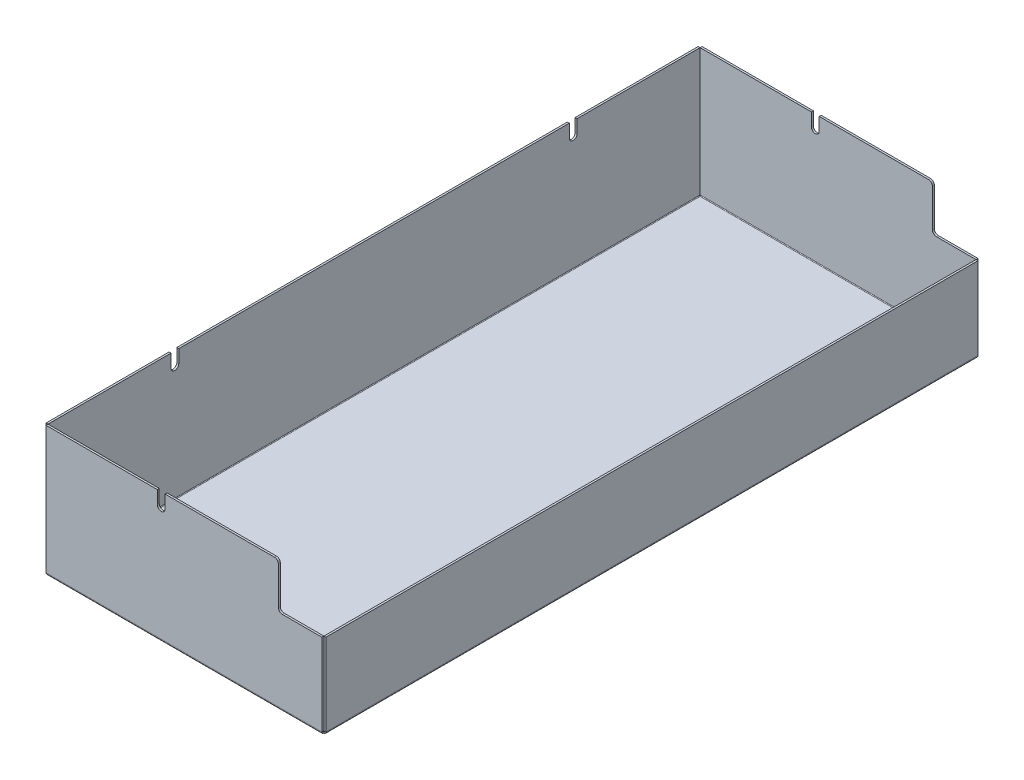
ISO-10303-21;
HEADER;
FILE_DESCRIPTION(('STEP AP214'),'2;1');
FILE_NAME('part.step','',(''),(''),'','','');
FILE_SCHEMA(('AUTOMOTIVE_DESIGN { 1 0 10303 214 1 1 1 1 }'));
ENDSEC;
DATA;
#1=APPLICATION_CONTEXT('core data for automotive mechanical design processes');
#2=APPLICATION_PROTOCOL_DEFINITION('international standard','automotive_design',2000,#1);
#3=PRODUCT_CONTEXT('',#1,'mechanical');
#4=PRODUCT('Part','Part','',(#3));
#5=PRODUCT_RELATED_PRODUCT_CATEGORY('part','',(#4));
#6=PRODUCT_DEFINITION_FORMATION('','',#4);
#7=PRODUCT_DEFINITION_CONTEXT('part definition',#1,'design');
#8=PRODUCT_DEFINITION('design','',#6,#7);
#9=PRODUCT_DEFINITION_SHAPE('','',#8);
#10=(LENGTH_UNIT() NAMED_UNIT(*) SI_UNIT(.MILLI.,.METRE.));
#11=(NAMED_UNIT(*) PLANE_ANGLE_UNIT() SI_UNIT($,.RADIAN.));
#12=(NAMED_UNIT(*) SI_UNIT($,.STERADIAN.) SOLID_ANGLE_UNIT());
#13=UNCERTAINTY_MEASURE_WITH_UNIT(LENGTH_MEASURE(1.E-05),#10,'distance_accuracy_value','');
#14=(GEOMETRIC_REPRESENTATION_CONTEXT(3) GLOBAL_UNCERTAINTY_ASSIGNED_CONTEXT((#13)) GLOBAL_UNIT_ASSIGNED_CONTEXT((#10,
#11,#12)) REPRESENTATION_CONTEXT('',''));
#15=CARTESIAN_POINT('',(0.,0.,0.));
#16=DIRECTION('',(0.,0.,1.));
#17=DIRECTION('',(1.,0.,0.));
#18=AXIS2_PLACEMENT_3D('',#15,#16,#17);
#19=CARTESIAN_POINT('',(-903.886083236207,15.,-252.));
#20=DIRECTION('',(0.,1.,0.));
#21=DIRECTION('',(-1.,0.,0.));
#22=AXIS2_PLACEMENT_3D('',#19,#20,#21);
#23=PLANE('',#22);
#24=DIRECTION('',(1.,0.,0.));
#25=VECTOR('',#24,1.);
#26=CARTESIAN_POINT('',(-903.886083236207,15.,250.5));
#27=LINE('',#26,#25);
#28=CARTESIAN_POINT('',(106.005,15.,250.5));
#29=VERTEX_POINT('',#28);
#30=CARTESIAN_POINT('',(107.5,15.,250.5));
#31=VERTEX_POINT('',#30);
#32=EDGE_CURVE('E427',#29,#31,#27,.T.);
#33=ORIENTED_EDGE('',*,*,#32,.T.);
#34=DIRECTION('',(0.,0.,1.));
#35=VECTOR('',#34,1.);
#36=CARTESIAN_POINT('',(107.5,15.,-250.5));
#37=LINE('',#36,#35);
#38=CARTESIAN_POINT('',(107.5,15.,-250.5));
#39=VERTEX_POINT('',#38);
#40=EDGE_CURVE('E107',#39,#31,#37,.T.);
#41=ORIENTED_EDGE('',*,*,#40,.F.);
#42=DIRECTION('',(1.,0.,0.));
#43=VECTOR('',#42,1.);
#44=CARTESIAN_POINT('',(-903.886083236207,15.,-250.5));
#45=LINE('',#44,#43);
#46=CARTESIAN_POINT('',(106.005,15.,-250.5));
#47=VERTEX_POINT('',#46);
#48=EDGE_CURVE('E414',#47,#39,#45,.T.);
#49=ORIENTED_EDGE('',*,*,#48,.F.);
#50=DIRECTION('',(0.,0.,-1.));
#51=VECTOR('',#50,1.);
#52=CARTESIAN_POINT('',(106.005,15.,-252.));
#53=LINE('',#52,#51);
#54=EDGE_CURVE('E941',#47,#29,#53,.F.);
#55=ORIENTED_EDGE('',*,*,#54,.T.);
#56=EDGE_LOOP('',(#33,#41,#49,#55));
#57=FACE_BOUND('',#56,.T.);
#58=ADVANCED_FACE('F59',(#57),#23,.T.);
#59=CARTESIAN_POINT('',(107.5,-50.,-252.));
#60=DIRECTION('',(1.,0.,0.));
#61=DIRECTION('',(0.,0.,-1.));
#62=AXIS2_PLACEMENT_3D('',#59,#60,#61);
#63=PLANE('',#62);
#64=ORIENTED_EDGE('',*,*,#40,.T.);
#65=DIRECTION('',(0.,1.,0.));
#66=VECTOR('',#65,1.);
#67=CARTESIAN_POINT('',(107.5,-48.,250.5));
#68=LINE('',#67,#66);
#69=CARTESIAN_POINT('',(107.5,-48.,250.5));
#70=VERTEX_POINT('',#69);
#71=EDGE_CURVE('E71',#70,#31,#68,.T.);
#72=ORIENTED_EDGE('',*,*,#71,.F.);
#73=DIRECTION('',(0.,0.,-1.));
#74=VECTOR('',#73,1.);
#75=CARTESIAN_POINT('',(107.5,-48.,250.5));
#76=LINE('',#75,#74);
#77=CARTESIAN_POINT('',(107.5,-47.9999999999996,-250.499999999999));
#78=VERTEX_POINT('',#77);
#79=EDGE_CURVE('E405',#70,#78,#76,.T.);
#80=ORIENTED_EDGE('',*,*,#79,.T.);
#81=DIRECTION('',(0.,1.,0.));
#82=VECTOR('',#81,1.);
#83=CARTESIAN_POINT('',(107.5,-48.,-250.5));
#84=LINE('',#83,#82);
#85=EDGE_CURVE('E407',#78,#39,#84,.T.);
#86=ORIENTED_EDGE('',*,*,#85,.T.);
#87=EDGE_LOOP('',(#64,#72,#80,#86));
#88=FACE_BOUND('',#87,.T.);
#89=ADVANCED_FACE('F406',(#88),#63,.T.);
#90=CARTESIAN_POINT('',(-903.886083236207,-50.,-250.5));
#91=DIRECTION('',(0.,0.,-1.));
#92=DIRECTION('',(0.,-1.,0.));
#93=AXIS2_PLACEMENT_3D('',#90,#91,#92);
#94=PLANE('',#93);
#95=ORIENTED_EDGE('',*,*,#48,.T.);
#96=ORIENTED_EDGE('',*,*,#85,.F.);
#97=CARTESIAN_POINT('',(106.005,-47.9999999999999,-250.499999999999));
#98=CARTESIAN_POINT('',(107.5,-47.9999999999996,-250.499999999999));
#99=B_SPLINE_CURVE_WITH_KNOTS('',1,(#97,#98),.UNSPECIFIED.,.F.,.F.,(2,2),(0.,1.),.UNSPECIFIED.);
#100=CARTESIAN_POINT('',(106.005,-47.9999999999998,-250.5));
#101=VERTEX_POINT('',#100);
#102=EDGE_CURVE('E98',#101,#78,#99,.T.);
#103=ORIENTED_EDGE('',*,*,#102,.F.);
#104=DIRECTION('',(0.,1.,0.));
#105=VECTOR('',#104,1.);
#106=CARTESIAN_POINT('',(106.005,-50.,-250.5));
#107=LINE('',#106,#105);
#108=EDGE_CURVE('E950',#101,#47,#107,.T.);
#109=ORIENTED_EDGE('',*,*,#108,.T.);
#110=EDGE_LOOP('',(#95,#96,#103,#109));
#111=FACE_BOUND('',#110,.T.);
#112=ADVANCED_FACE('F413',(#111),#94,.T.);
#113=CARTESIAN_POINT('',(106.005,-50.,-252.));
#114=DIRECTION('',(1.,0.,0.));
#115=DIRECTION('',(0.,0.,-1.));
#116=AXIS2_PLACEMENT_3D('',#113,#114,#115);
#117=PLANE('',#116);
#118=ORIENTED_EDGE('',*,*,#54,.F.);
#119=ORIENTED_EDGE('',*,*,#108,.F.);
#120=DIRECTION('',(0.,0.,-1.));
#121=VECTOR('',#120,1.);
#122=CARTESIAN_POINT('',(106.005,-48.,-252.));
#123=LINE('',#122,#121);
#124=CARTESIAN_POINT('',(106.005,-48.,250.5));
#125=VERTEX_POINT('',#124);
#126=EDGE_CURVE('E428',#125,#101,#123,.T.);
#127=ORIENTED_EDGE('',*,*,#126,.F.);
#128=DIRECTION('',(0.,1.,0.));
#129=VECTOR('',#128,1.);
#130=CARTESIAN_POINT('',(106.005,-50.,250.5));
#131=LINE('',#130,#129);
#132=EDGE_CURVE('E954',#125,#29,#131,.T.);
#133=ORIENTED_EDGE('',*,*,#132,.T.);
#134=EDGE_LOOP('',(#118,#119,#127,#133));
#135=FACE_BOUND('',#134,.T.);
#136=ADVANCED_FACE('F927',(#135),#117,.F.);
#137=CARTESIAN_POINT('',(-903.886083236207,-50.,250.5));
#138=DIRECTION('',(0.,0.,-1.));
#139=DIRECTION('',(0.,-1.,0.));
#140=AXIS2_PLACEMENT_3D('',#137,#138,#139);
#141=PLANE('',#140);
#142=ORIENTED_EDGE('',*,*,#71,.T.);
#143=ORIENTED_EDGE('',*,*,#32,.F.);
#144=ORIENTED_EDGE('',*,*,#132,.F.);
#145=CARTESIAN_POINT('',(107.5,-47.9999999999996,250.5));
#146=CARTESIAN_POINT('',(106.005,-47.9999999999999,250.5));
#147=B_SPLINE_CURVE_WITH_KNOTS('',1,(#145,#146),.UNSPECIFIED.,.F.,.F.,(2,2),(0.,1.),.UNSPECIFIED.);
#148=EDGE_CURVE('E13',#125,#70,#147,.F.);
#149=ORIENTED_EDGE('',*,*,#148,.T.);
#150=EDGE_LOOP('',(#142,#143,#144,#149));
#151=FACE_BOUND('',#150,.T.);
#152=ADVANCED_FACE('F61',(#151),#141,.F.);
#153=CARTESIAN_POINT('',(0.,50.,216.60526535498));
#154=DIRECTION('',(0.,-1.,0.));
#155=DIRECTION('',(0.,0.,-1.));
#156=AXIS2_PLACEMENT_3D('',#153,#154,#155);
#157=PLANE('',#156);
#158=DIRECTION('',(-1.,0.,0.));
#159=VECTOR('',#158,1.);
#160=CARTESIAN_POINT('',(69.5,50.,-252.));
#161=LINE('',#160,#159);
#162=CARTESIAN_POINT('',(69.5,50.,-252.));
#163=VERTEX_POINT('',#162);
#164=CARTESIAN_POINT('',(-14.5,50.,-252.));
#165=VERTEX_POINT('',#164);
#166=EDGE_CURVE('E1897',#163,#165,#161,.T.);
#167=ORIENTED_EDGE('',*,*,#166,.T.);
#168=DIRECTION('',(0.,0.,-1.));
#169=VECTOR('',#168,1.);
#170=CARTESIAN_POINT('',(-14.5,50.,216.60526535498));
#171=LINE('',#170,#169);
#172=CARTESIAN_POINT('',(-14.5,50.,-250.505));
#173=VERTEX_POINT('',#172);
#174=EDGE_CURVE('E1890',#173,#165,#171,.T.);
#175=ORIENTED_EDGE('',*,*,#174,.F.);
#176=DIRECTION('',(-1.,0.,0.));
#177=VECTOR('',#176,1.);
#178=CARTESIAN_POINT('',(0.,50.,-250.505));
#179=LINE('',#178,#177);
#180=CARTESIAN_POINT('',(69.5,50.,-250.505));
#181=VERTEX_POINT('',#180);
#182=EDGE_CURVE('E193',#181,#173,#179,.T.);
#183=ORIENTED_EDGE('',*,*,#182,.F.);
#184=DIRECTION('',(0.,0.,-1.));
#185=VECTOR('',#184,1.);
#186=CARTESIAN_POINT('',(69.5,50.,216.60526535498));
#187=LINE('',#186,#185);
#188=EDGE_CURVE('E1895',#181,#163,#187,.T.);
#189=ORIENTED_EDGE('',*,*,#188,.T.);
#190=EDGE_LOOP('',(#167,#175,#183,#189));
#191=FACE_BOUND('',#190,.T.);
#192=ADVANCED_FACE('F846',(#191),#157,.F.);
#193=CARTESIAN_POINT('',(-14.5,0.,216.60526535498));
#194=DIRECTION('',(1.,0.,0.));
#195=DIRECTION('',(0.,1.,0.));
#196=AXIS2_PLACEMENT_3D('',#193,#194,#195);
#197=PLANE('',#196);
#198=DIRECTION('',(0.,-1.,0.));
#199=VECTOR('',#198,1.);
#200=CARTESIAN_POINT('',(-14.5,50.,-252.));
#201=LINE('',#200,#199);
#202=CARTESIAN_POINT('',(-14.5,40.,-252.));
#203=VERTEX_POINT('',#202);
#204=EDGE_CURVE('E1892',#165,#203,#201,.T.);
#205=ORIENTED_EDGE('',*,*,#204,.T.);
#206=DIRECTION('',(0.,0.,-1.));
#207=VECTOR('',#206,1.);
#208=CARTESIAN_POINT('',(-14.5,40.,216.60526535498));
#209=LINE('',#208,#207);
#210=CARTESIAN_POINT('',(-14.5,40.0000000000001,-250.505));
#211=VERTEX_POINT('',#210);
#212=EDGE_CURVE('E1887',#211,#203,#209,.T.);
#213=ORIENTED_EDGE('',*,*,#212,.F.);
#214=DIRECTION('',(0.,1.,0.));
#215=VECTOR('',#214,1.);
#216=CARTESIAN_POINT('',(-14.5,0.,-250.505));
#217=LINE('',#216,#215);
#218=EDGE_CURVE('E186',#173,#211,#217,.F.);
#219=ORIENTED_EDGE('',*,*,#218,.F.);
#220=ORIENTED_EDGE('',*,*,#174,.T.);
#221=EDGE_LOOP('',(#205,#213,#219,#220));
#222=FACE_BOUND('',#221,.T.);
#223=ADVANCED_FACE('F849',(#222),#197,.F.);
#224=CARTESIAN_POINT('',(-17.5,40.,216.60526535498));
#225=DIRECTION('',(0.,0.,-1.));
#226=DIRECTION('',(0.,1.,0.));
#227=AXIS2_PLACEMENT_3D('',#224,#225,#226);
#228=CYLINDRICAL_SURFACE('',#227,3.);
#229=ORIENTED_EDGE('',*,*,#212,.T.);
#230=CARTESIAN_POINT('',(-17.5,40.,-252.));
#231=DIRECTION('',(0.,0.,1.));
#232=DIRECTION('',(-1.,0.,0.));
#233=AXIS2_PLACEMENT_3D('',#230,#231,#232);
#234=CIRCLE('',#233,3.);
#235=CARTESIAN_POINT('',(-20.5,40.,-252.));
#236=VERTEX_POINT('',#235);
#237=EDGE_CURVE('E1841',#236,#203,#234,.T.);
#238=ORIENTED_EDGE('',*,*,#237,.F.);
#239=DIRECTION('',(0.,0.,-1.));
#240=VECTOR('',#239,1.);
#241=CARTESIAN_POINT('',(-20.5,40.,216.60526535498));
#242=LINE('',#241,#240);
#243=CARTESIAN_POINT('',(-20.5,40.0000000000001,-250.505));
#244=VERTEX_POINT('',#243);
#245=EDGE_CURVE('E1882',#244,#236,#242,.T.);
#246=ORIENTED_EDGE('',*,*,#245,.F.);
#247=CARTESIAN_POINT('',(-17.5,40.,-250.505));
#248=DIRECTION('',(0.,0.,1.));
#249=DIRECTION('',(1.,0.,0.));
#250=AXIS2_PLACEMENT_3D('',#247,#248,#249);
#251=CIRCLE('',#250,3.);
#252=EDGE_CURVE('E1885',#244,#211,#251,.T.);
#253=ORIENTED_EDGE('',*,*,#252,.T.);
#254=EDGE_LOOP('',(#229,#238,#246,#253));
#255=FACE_BOUND('',#254,.T.);
#256=ADVANCED_FACE('F852',(#255),#228,.F.);
#257=CARTESIAN_POINT('',(-20.5,0.,216.60526535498));
#258=DIRECTION('',(1.,0.,0.));
#259=DIRECTION('',(0.,1.,0.));
#260=AXIS2_PLACEMENT_3D('',#257,#258,#259);
#261=PLANE('',#260);
#262=ORIENTED_EDGE('',*,*,#245,.T.);
#263=DIRECTION('',(0.,-1.,0.));
#264=VECTOR('',#263,1.);
#265=CARTESIAN_POINT('',(-20.5,50.,-252.));
#266=LINE('',#265,#264);
#267=CARTESIAN_POINT('',(-20.5,50.,-252.));
#268=VERTEX_POINT('',#267);
#269=EDGE_CURVE('E1838',#268,#236,#266,.T.);
#270=ORIENTED_EDGE('',*,*,#269,.F.);
#271=DIRECTION('',(0.,0.,-1.));
#272=VECTOR('',#271,1.);
#273=CARTESIAN_POINT('',(-20.5,50.,216.60526535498));
#274=LINE('',#273,#272);
#275=CARTESIAN_POINT('',(-20.5,50.,-250.505));
#276=VERTEX_POINT('',#275);
#277=EDGE_CURVE('E1874',#276,#268,#274,.T.);
#278=ORIENTED_EDGE('',*,*,#277,.F.);
#279=DIRECTION('',(0.,1.,0.));
#280=VECTOR('',#279,1.);
#281=CARTESIAN_POINT('',(-20.5,0.,-250.505));
#282=LINE('',#281,#280);
#283=EDGE_CURVE('E1880',#276,#244,#282,.F.);
#284=ORIENTED_EDGE('',*,*,#283,.T.);
#285=EDGE_LOOP('',(#262,#270,#278,#284));
#286=FACE_BOUND('',#285,.T.);
#287=ADVANCED_FACE('F855',(#286),#261,.T.);
#288=CARTESIAN_POINT('',(0.,50.,216.60526535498));
#289=DIRECTION('',(0.,-1.,0.));
#290=DIRECTION('',(0.,0.,-1.));
#291=AXIS2_PLACEMENT_3D('',#288,#289,#290);
#292=PLANE('',#291);
#293=DIRECTION('',(-1.,0.,0.));
#294=VECTOR('',#293,1.);
#295=CARTESIAN_POINT('',(-20.5,50.,-252.));
#296=LINE('',#295,#294);
#297=CARTESIAN_POINT('',(-106.,50.,-252.));
#298=VERTEX_POINT('',#297);
#299=EDGE_CURVE('E1877',#268,#298,#296,.T.);
#300=ORIENTED_EDGE('',*,*,#299,.T.);
#301=DIRECTION('',(0.,0.,-1.));
#302=VECTOR('',#301,1.);
#303=CARTESIAN_POINT('',(-106.,50.,216.60526535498));
#304=LINE('',#303,#302);
#305=CARTESIAN_POINT('',(-106.,50.,-250.505));
#306=VERTEX_POINT('',#305);
#307=EDGE_CURVE('E1906',#306,#298,#304,.T.);
#308=ORIENTED_EDGE('',*,*,#307,.F.);
#309=DIRECTION('',(-1.,0.,0.));
#310=VECTOR('',#309,1.);
#311=CARTESIAN_POINT('',(0.,50.,-250.505));
#312=LINE('',#311,#310);
#313=EDGE_CURVE('E1914',#276,#306,#312,.T.);
#314=ORIENTED_EDGE('',*,*,#313,.F.);
#315=ORIENTED_EDGE('',*,*,#277,.T.);
#316=EDGE_LOOP('',(#300,#308,#314,#315));
#317=FACE_BOUND('',#316,.T.);
#318=ADVANCED_FACE('F859',(#317),#292,.F.);
#319=CARTESIAN_POINT('',(0.,15.,216.60526535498));
#320=DIRECTION('',(0.,-1.,0.));
#321=DIRECTION('',(0.,0.,-1.));
#322=AXIS2_PLACEMENT_3D('',#319,#320,#321);
#323=PLANE('',#322);
#324=DIRECTION('',(-1.,0.,0.));
#325=VECTOR('',#324,1.);
#326=CARTESIAN_POINT('',(106.,15.,-252.));
#327=LINE('',#326,#325);
#328=CARTESIAN_POINT('',(106.,15.,-252.));
#329=VERTEX_POINT('',#328);
#330=CARTESIAN_POINT('',(75.5,15.,-252.));
#331=VERTEX_POINT('',#330);
#332=EDGE_CURVE('E1871',#329,#331,#327,.T.);
#333=ORIENTED_EDGE('',*,*,#332,.T.);
#334=DIRECTION('',(0.,0.,-1.));
#335=VECTOR('',#334,1.);
#336=CARTESIAN_POINT('',(75.5,15.,216.60526535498));
#337=LINE('',#336,#335);
#338=CARTESIAN_POINT('',(75.5,15.0000000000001,-250.505));
#339=VERTEX_POINT('',#338);
#340=EDGE_CURVE('E1865',#339,#331,#337,.T.);
#341=ORIENTED_EDGE('',*,*,#340,.F.);
#342=DIRECTION('',(-1.,0.,0.));
#343=VECTOR('',#342,1.);
#344=CARTESIAN_POINT('',(0.,15.,-250.505));
#345=LINE('',#344,#343);
#346=CARTESIAN_POINT('',(106.,15.0000000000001,-250.505));
#347=VERTEX_POINT('',#346);
#348=EDGE_CURVE('E1923',#347,#339,#345,.T.);
#349=ORIENTED_EDGE('',*,*,#348,.F.);
#350=DIRECTION('',(0.,0.,-1.));
#351=VECTOR('',#350,1.);
#352=CARTESIAN_POINT('',(106.,15.,216.60526535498));
#353=LINE('',#352,#351);
#354=EDGE_CURVE('E1868',#347,#329,#353,.T.);
#355=ORIENTED_EDGE('',*,*,#354,.T.);
#356=EDGE_LOOP('',(#333,#341,#349,#355));
#357=FACE_BOUND('',#356,.T.);
#358=ADVANCED_FACE('F863',(#357),#323,.F.);
#359=CARTESIAN_POINT('',(75.5,18.,216.60526535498));
#360=DIRECTION('',(0.,0.,-1.));
#361=DIRECTION('',(0.,1.,0.));
#362=AXIS2_PLACEMENT_3D('',#359,#360,#361);
#363=CYLINDRICAL_SURFACE('',#362,3.);
#364=ORIENTED_EDGE('',*,*,#340,.T.);
#365=CARTESIAN_POINT('',(75.5,18.,-252.));
#366=DIRECTION('',(0.,0.,1.));
#367=DIRECTION('',(-1.,0.,0.));
#368=AXIS2_PLACEMENT_3D('',#365,#366,#367);
#369=CIRCLE('',#368,3.);
#370=CARTESIAN_POINT('',(72.5,18.,-252.));
#371=VERTEX_POINT('',#370);
#372=EDGE_CURVE('E1839',#371,#331,#369,.T.);
#373=ORIENTED_EDGE('',*,*,#372,.F.);
#374=DIRECTION('',(0.,0.,-1.));
#375=VECTOR('',#374,1.);
#376=CARTESIAN_POINT('',(72.5,18.,216.60526535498));
#377=LINE('',#376,#375);
#378=CARTESIAN_POINT('',(72.5,18.0000000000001,-250.505));
#379=VERTEX_POINT('',#378);
#380=EDGE_CURVE('E1860',#379,#371,#377,.T.);
#381=ORIENTED_EDGE('',*,*,#380,.F.);
#382=CARTESIAN_POINT('',(75.5,18.,-250.505));
#383=DIRECTION('',(0.,0.,1.));
#384=DIRECTION('',(1.,0.,0.));
#385=AXIS2_PLACEMENT_3D('',#382,#383,#384);
#386=CIRCLE('',#385,3.);
#387=EDGE_CURVE('E1863',#379,#339,#386,.T.);
#388=ORIENTED_EDGE('',*,*,#387,.T.);
#389=EDGE_LOOP('',(#364,#373,#381,#388));
#390=FACE_BOUND('',#389,.T.);
#391=ADVANCED_FACE('F867',(#390),#363,.F.);
#392=CARTESIAN_POINT('',(72.5,0.,216.60526535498));
#393=DIRECTION('',(1.,0.,0.));
#394=DIRECTION('',(0.,1.,0.));
#395=AXIS2_PLACEMENT_3D('',#392,#393,#394);
#396=PLANE('',#395);
#397=ORIENTED_EDGE('',*,*,#380,.T.);
#398=DIRECTION('',(0.,-1.,0.));
#399=VECTOR('',#398,1.);
#400=CARTESIAN_POINT('',(72.5,47.,-252.));
#401=LINE('',#400,#399);
#402=CARTESIAN_POINT('',(72.5,47.,-252.));
#403=VERTEX_POINT('',#402);
#404=EDGE_CURVE('E1843',#403,#371,#401,.T.);
#405=ORIENTED_EDGE('',*,*,#404,.F.);
#406=DIRECTION('',(0.,0.,-1.));
#407=VECTOR('',#406,1.);
#408=CARTESIAN_POINT('',(72.5,47.,216.60526535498));
#409=LINE('',#408,#407);
#410=CARTESIAN_POINT('',(72.5,47.,-250.505));
#411=VERTEX_POINT('',#410);
#412=EDGE_CURVE('E1855',#411,#403,#409,.T.);
#413=ORIENTED_EDGE('',*,*,#412,.F.);
#414=DIRECTION('',(0.,1.,0.));
#415=VECTOR('',#414,1.);
#416=CARTESIAN_POINT('',(72.5,0.,-250.505));
#417=LINE('',#416,#415);
#418=EDGE_CURVE('E1858',#411,#379,#417,.F.);
#419=ORIENTED_EDGE('',*,*,#418,.T.);
#420=EDGE_LOOP('',(#397,#405,#413,#419));
#421=FACE_BOUND('',#420,.T.);
#422=ADVANCED_FACE('F871',(#421),#396,.T.);
#423=CARTESIAN_POINT('',(69.5,47.,216.60526535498));
#424=DIRECTION('',(0.,0.,-1.));
#425=DIRECTION('',(0.,1.,0.));
#426=AXIS2_PLACEMENT_3D('',#423,#424,#425);
#427=CYLINDRICAL_SURFACE('',#426,3.);
#428=ORIENTED_EDGE('',*,*,#412,.T.);
#429=CARTESIAN_POINT('',(69.5,47.,-252.));
#430=DIRECTION('',(0.,0.,-1.));
#431=DIRECTION('',(0.,1.,0.));
#432=AXIS2_PLACEMENT_3D('',#429,#430,#431);
#433=CIRCLE('',#432,3.);
#434=EDGE_CURVE('E1850',#163,#403,#433,.T.);
#435=ORIENTED_EDGE('',*,*,#434,.F.);
#436=ORIENTED_EDGE('',*,*,#188,.F.);
#437=CARTESIAN_POINT('',(69.5,47.,-250.505));
#438=DIRECTION('',(0.,0.,-1.));
#439=DIRECTION('',(-1.,0.,0.));
#440=AXIS2_PLACEMENT_3D('',#437,#438,#439);
#441=CIRCLE('',#440,3.);
#442=EDGE_CURVE('E1852',#181,#411,#441,.T.);
#443=ORIENTED_EDGE('',*,*,#442,.T.);
#444=EDGE_LOOP('',(#428,#435,#436,#443));
#445=FACE_BOUND('',#444,.T.);
#446=ADVANCED_FACE('F875',(#445),#427,.T.);
#447=CARTESIAN_POINT('',(0.,0.,-252.));
#448=DIRECTION('',(0.,0.,-1.));
#449=DIRECTION('',(-1.,0.,0.));
#450=AXIS2_PLACEMENT_3D('',#447,#448,#449);
#451=PLANE('',#450);
#452=ORIENTED_EDGE('',*,*,#434,.T.);
#453=ORIENTED_EDGE('',*,*,#404,.T.);
#454=ORIENTED_EDGE('',*,*,#372,.T.);
#455=ORIENTED_EDGE('',*,*,#332,.F.);
#456=DIRECTION('',(0.,1.,0.));
#457=VECTOR('',#456,1.);
#458=CARTESIAN_POINT('',(106.,-48.,-252.));
#459=LINE('',#458,#457);
#460=CARTESIAN_POINT('',(106.,-48.,-252.));
#461=VERTEX_POINT('',#460);
#462=EDGE_CURVE('E1926',#461,#329,#459,.T.);
#463=ORIENTED_EDGE('',*,*,#462,.F.);
#464=DIRECTION('',(-1.,0.,0.));
#465=VECTOR('',#464,1.);
#466=CARTESIAN_POINT('',(106.,-48.,-252.));
#467=LINE('',#466,#465);
#468=CARTESIAN_POINT('',(-105.999999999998,-47.9999999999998,-252.));
#469=VERTEX_POINT('',#468);
#470=EDGE_CURVE('E1731',#461,#469,#467,.T.);
#471=ORIENTED_EDGE('',*,*,#470,.T.);
#472=DIRECTION('',(0.,-1.,0.));
#473=VECTOR('',#472,1.);
#474=CARTESIAN_POINT('',(-106.,50.,-252.));
#475=LINE('',#474,#473);
#476=EDGE_CURVE('E1905',#298,#469,#475,.T.);
#477=ORIENTED_EDGE('',*,*,#476,.F.);
#478=ORIENTED_EDGE('',*,*,#299,.F.);
#479=ORIENTED_EDGE('',*,*,#269,.T.);
#480=ORIENTED_EDGE('',*,*,#237,.T.);
#481=ORIENTED_EDGE('',*,*,#204,.F.);
#482=ORIENTED_EDGE('',*,*,#166,.F.);
#483=EDGE_LOOP('',(#452,#453,#454,#455,#463,#471,#477,#478,#479,#480,#481,#482));
#484=FACE_BOUND('',#483,.T.);
#485=ADVANCED_FACE('F879',(#484),#451,.T.);
#486=CARTESIAN_POINT('',(-106.,0.,216.60526535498));
#487=DIRECTION('',(1.,0.,0.));
#488=DIRECTION('',(0.,1.,0.));
#489=AXIS2_PLACEMENT_3D('',#486,#487,#488);
#490=PLANE('',#489);
#491=ORIENTED_EDGE('',*,*,#476,.T.);
#492=CARTESIAN_POINT('',(-105.999999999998,-48.,-250.505));
#493=CARTESIAN_POINT('',(-105.999999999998,-47.9999999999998,-252.));
#494=B_SPLINE_CURVE_WITH_KNOTS('',1,(#492,#493),.UNSPECIFIED.,.F.,.F.,(2,2),(0.,1.),.UNSPECIFIED.);
#495=CARTESIAN_POINT('',(-105.999999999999,-47.9999999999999,-250.505));
#496=VERTEX_POINT('',#495);
#497=EDGE_CURVE('E1900',#496,#469,#494,.T.);
#498=ORIENTED_EDGE('',*,*,#497,.F.);
#499=DIRECTION('',(0.,1.,0.));
#500=VECTOR('',#499,1.);
#501=CARTESIAN_POINT('',(-106.,0.,-250.505));
#502=LINE('',#501,#500);
#503=EDGE_CURVE('E1903',#306,#496,#502,.F.);
#504=ORIENTED_EDGE('',*,*,#503,.F.);
#505=ORIENTED_EDGE('',*,*,#307,.T.);
#506=EDGE_LOOP('',(#491,#498,#504,#505));
#507=FACE_BOUND('',#506,.T.);
#508=ADVANCED_FACE('F883',(#507),#490,.F.);
#509=CARTESIAN_POINT('',(0.,0.,-250.505));
#510=DIRECTION('',(0.,0.,-1.));
#511=DIRECTION('',(-1.,0.,0.));
#512=AXIS2_PLACEMENT_3D('',#509,#510,#511);
#513=PLANE('',#512);
#514=ORIENTED_EDGE('',*,*,#442,.F.);
#515=ORIENTED_EDGE('',*,*,#182,.T.);
#516=ORIENTED_EDGE('',*,*,#218,.T.);
#517=ORIENTED_EDGE('',*,*,#252,.F.);
#518=ORIENTED_EDGE('',*,*,#283,.F.);
#519=ORIENTED_EDGE('',*,*,#313,.T.);
#520=ORIENTED_EDGE('',*,*,#503,.T.);
#521=DIRECTION('',(-1.,0.,0.));
#522=VECTOR('',#521,1.);
#523=CARTESIAN_POINT('',(0.,-48.,-250.505));
#524=LINE('',#523,#522);
#525=CARTESIAN_POINT('',(106.,-47.9999999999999,-250.505));
#526=VERTEX_POINT('',#525);
#527=EDGE_CURVE('E725',#526,#496,#524,.T.);
#528=ORIENTED_EDGE('',*,*,#527,.F.);
#529=DIRECTION('',(0.,1.,0.));
#530=VECTOR('',#529,1.);
#531=CARTESIAN_POINT('',(106.,0.,-250.505));
#532=LINE('',#531,#530);
#533=EDGE_CURVE('E116',#526,#347,#532,.T.);
#534=ORIENTED_EDGE('',*,*,#533,.T.);
#535=ORIENTED_EDGE('',*,*,#348,.T.);
#536=ORIENTED_EDGE('',*,*,#387,.F.);
#537=ORIENTED_EDGE('',*,*,#418,.F.);
#538=EDGE_LOOP('',(#514,#515,#516,#517,#518,#519,#520,#528,#534,#535,#536,#537));
#539=FACE_BOUND('',#538,.T.);
#540=ADVANCED_FACE('F888',(#539),#513,.F.);
#541=CARTESIAN_POINT('',(106.,0.,216.60526535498));
#542=DIRECTION('',(-1.,0.,0.));
#543=DIRECTION('',(0.,-1.,0.));
#544=AXIS2_PLACEMENT_3D('',#541,#542,#543);
#545=PLANE('',#544);
#546=ORIENTED_EDGE('',*,*,#462,.T.);
#547=ORIENTED_EDGE('',*,*,#354,.F.);
#548=ORIENTED_EDGE('',*,*,#533,.F.);
#549=CARTESIAN_POINT('',(106.000000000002,-47.9999999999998,-252.));
#550=CARTESIAN_POINT('',(106.000000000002,-48.,-250.505));
#551=B_SPLINE_CURVE_WITH_KNOTS('',1,(#549,#550),.UNSPECIFIED.,.F.,.F.,(2,2),(0.,1.),.UNSPECIFIED.);
#552=EDGE_CURVE('E906',#526,#461,#551,.F.);
#553=ORIENTED_EDGE('',*,*,#552,.T.);
#554=EDGE_LOOP('',(#546,#547,#548,#553));
#555=FACE_BOUND('',#554,.T.);
#556=ADVANCED_FACE('F912',(#555),#545,.F.);
#557=CARTESIAN_POINT('',(914.984715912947,50.,-252.));
#558=DIRECTION('',(0.,-1.,0.));
#559=DIRECTION('',(1.,0.,0.));
#560=AXIS2_PLACEMENT_3D('',#557,#558,#559);
#561=PLANE('',#560);
#562=DIRECTION('',(0.,0.,1.));
#563=VECTOR('',#562,1.);
#564=CARTESIAN_POINT('',(-107.5,50.,-150.));
#565=LINE('',#564,#563);
#566=CARTESIAN_POINT('',(-107.5,50.,-150.));
#567=VERTEX_POINT('',#566);
#568=CARTESIAN_POINT('',(-107.5,50.,150.));
#569=VERTEX_POINT('',#568);
#570=EDGE_CURVE('E814',#567,#569,#565,.T.);
#571=ORIENTED_EDGE('',*,*,#570,.T.);
#572=DIRECTION('',(-1.,0.,0.));
#573=VECTOR('',#572,1.);
#574=CARTESIAN_POINT('',(914.984715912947,50.,150.));
#575=LINE('',#574,#573);
#576=CARTESIAN_POINT('',(-106.005,50.,150.));
#577=VERTEX_POINT('',#576);
#578=EDGE_CURVE('E807',#577,#569,#575,.T.);
#579=ORIENTED_EDGE('',*,*,#578,.F.);
#580=DIRECTION('',(0.,0.,1.));
#581=VECTOR('',#580,1.);
#582=CARTESIAN_POINT('',(-106.005,50.,-252.));
#583=LINE('',#582,#581);
#584=CARTESIAN_POINT('',(-106.005,50.,-150.));
#585=VERTEX_POINT('',#584);
#586=EDGE_CURVE('E278',#585,#577,#583,.T.);
#587=ORIENTED_EDGE('',*,*,#586,.F.);
#588=DIRECTION('',(-1.,0.,0.));
#589=VECTOR('',#588,1.);
#590=CARTESIAN_POINT('',(914.984715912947,50.,-150.));
#591=LINE('',#590,#589);
#592=EDGE_CURVE('E812',#585,#567,#591,.T.);
#593=ORIENTED_EDGE('',*,*,#592,.T.);
#594=EDGE_LOOP('',(#571,#579,#587,#593));
#595=FACE_BOUND('',#594,.T.);
#596=ADVANCED_FACE('F712',(#595),#561,.F.);
#597=CARTESIAN_POINT('',(914.984715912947,50.,150.));
#598=DIRECTION('',(0.,0.,-1.));
#599=DIRECTION('',(0.,1.,0.));
#600=AXIS2_PLACEMENT_3D('',#597,#598,#599);
#601=PLANE('',#600);
#602=DIRECTION('',(0.,-1.,0.));
#603=VECTOR('',#602,1.);
#604=CARTESIAN_POINT('',(-107.5,50.,150.));
#605=LINE('',#604,#603);
#606=CARTESIAN_POINT('',(-107.5,40.,150.));
#607=VERTEX_POINT('',#606);
#608=EDGE_CURVE('E809',#569,#607,#605,.T.);
#609=ORIENTED_EDGE('',*,*,#608,.T.);
#610=DIRECTION('',(-1.,0.,0.));
#611=VECTOR('',#610,1.);
#612=CARTESIAN_POINT('',(914.984715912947,40.,150.));
#613=LINE('',#612,#611);
#614=CARTESIAN_POINT('',(-106.005,40.,150.));
#615=VERTEX_POINT('',#614);
#616=EDGE_CURVE('E801',#615,#607,#613,.T.);
#617=ORIENTED_EDGE('',*,*,#616,.F.);
#618=DIRECTION('',(0.,1.,0.));
#619=VECTOR('',#618,1.);
#620=CARTESIAN_POINT('',(-106.005,50.,150.));
#621=LINE('',#620,#619);
#622=EDGE_CURVE('E271',#577,#615,#621,.F.);
#623=ORIENTED_EDGE('',*,*,#622,.F.);
#624=ORIENTED_EDGE('',*,*,#578,.T.);
#625=EDGE_LOOP('',(#609,#617,#623,#624));
#626=FACE_BOUND('',#625,.T.);
#627=ADVANCED_FACE('F1026',(#626),#601,.F.);
#628=CARTESIAN_POINT('',(914.984715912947,40.,153.));
#629=DIRECTION('',(-1.,0.,0.));
#630=DIRECTION('',(0.,-1.,0.));
#631=AXIS2_PLACEMENT_3D('',#628,#629,#630);
#632=CYLINDRICAL_SURFACE('',#631,3.);
#633=CARTESIAN_POINT('',(-107.5,40.,153.));
#634=DIRECTION('',(-1.,0.,0.));
#635=DIRECTION('',(0.,0.,-1.));
#636=AXIS2_PLACEMENT_3D('',#633,#634,#635);
#637=CIRCLE('',#636,3.);
#638=CARTESIAN_POINT('',(-107.5,40.,156.));
#639=VERTEX_POINT('',#638);
#640=EDGE_CURVE('E804',#607,#639,#637,.T.);
#641=ORIENTED_EDGE('',*,*,#640,.T.);
#642=DIRECTION('',(-1.,0.,0.));
#643=VECTOR('',#642,1.);
#644=CARTESIAN_POINT('',(914.984715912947,40.,156.));
#645=LINE('',#644,#643);
#646=CARTESIAN_POINT('',(-106.005,40.,156.));
#647=VERTEX_POINT('',#646);
#648=EDGE_CURVE('E798',#647,#639,#645,.T.);
#649=ORIENTED_EDGE('',*,*,#648,.F.);
#650=CARTESIAN_POINT('',(-106.005,40.,153.));
#651=DIRECTION('',(-1.,0.,0.));
#652=DIRECTION('',(0.,0.,1.));
#653=AXIS2_PLACEMENT_3D('',#650,#651,#652);
#654=CIRCLE('',#653,3.);
#655=EDGE_CURVE('E740',#615,#647,#654,.T.);
#656=ORIENTED_EDGE('',*,*,#655,.F.);
#657=ORIENTED_EDGE('',*,*,#616,.T.);
#658=EDGE_LOOP('',(#641,#649,#656,#657));
#659=FACE_BOUND('',#658,.T.);
#660=ADVANCED_FACE('F1032',(#659),#632,.F.);
#661=CARTESIAN_POINT('',(914.984715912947,50.,156.));
#662=DIRECTION('',(0.,0.,-1.));
#663=DIRECTION('',(0.,1.,0.));
#664=AXIS2_PLACEMENT_3D('',#661,#662,#663);
#665=PLANE('',#664);
#666=ORIENTED_EDGE('',*,*,#648,.T.);
#667=DIRECTION('',(0.,-1.,0.));
#668=VECTOR('',#667,1.);
#669=CARTESIAN_POINT('',(-107.5,50.,156.));
#670=LINE('',#669,#668);
#671=CARTESIAN_POINT('',(-107.5,50.,156.));
#672=VERTEX_POINT('',#671);
#673=EDGE_CURVE('E749',#672,#639,#670,.T.);
#674=ORIENTED_EDGE('',*,*,#673,.F.);
#675=DIRECTION('',(-1.,0.,0.));
#676=VECTOR('',#675,1.);
#677=CARTESIAN_POINT('',(914.984715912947,50.,156.));
#678=LINE('',#677,#676);
#679=CARTESIAN_POINT('',(-106.005,50.,156.));
#680=VERTEX_POINT('',#679);
#681=EDGE_CURVE('E790',#680,#672,#678,.T.);
#682=ORIENTED_EDGE('',*,*,#681,.F.);
#683=DIRECTION('',(0.,1.,0.));
#684=VECTOR('',#683,1.);
#685=CARTESIAN_POINT('',(-106.005,50.,156.));
#686=LINE('',#685,#684);
#687=EDGE_CURVE('E796',#680,#647,#686,.F.);
#688=ORIENTED_EDGE('',*,*,#687,.T.);
#689=EDGE_LOOP('',(#666,#674,#682,#688));
#690=FACE_BOUND('',#689,.T.);
#691=ADVANCED_FACE('F1038',(#690),#665,.T.);
#692=CARTESIAN_POINT('',(914.984715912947,50.,-252.));
#693=DIRECTION('',(0.,-1.,0.));
#694=DIRECTION('',(1.,0.,0.));
#695=AXIS2_PLACEMENT_3D('',#692,#693,#694);
#696=PLANE('',#695);
#697=DIRECTION('',(0.,0.,1.));
#698=VECTOR('',#697,1.);
#699=CARTESIAN_POINT('',(-107.5,50.,156.));
#700=LINE('',#699,#698);
#701=CARTESIAN_POINT('',(-107.5,50.,250.5));
#702=VERTEX_POINT('',#701);
#703=EDGE_CURVE('E793',#672,#702,#700,.T.);
#704=ORIENTED_EDGE('',*,*,#703,.T.);
#705=DIRECTION('',(-1.,0.,0.));
#706=VECTOR('',#705,1.);
#707=CARTESIAN_POINT('',(914.984715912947,50.,250.5));
#708=LINE('',#707,#706);
#709=CARTESIAN_POINT('',(-106.005,50.,250.5));
#710=VERTEX_POINT('',#709);
#711=EDGE_CURVE('E745',#710,#702,#708,.T.);
#712=ORIENTED_EDGE('',*,*,#711,.F.);
#713=DIRECTION('',(0.,0.,1.));
#714=VECTOR('',#713,1.);
#715=CARTESIAN_POINT('',(-106.005,50.,-252.));
#716=LINE('',#715,#714);
#717=EDGE_CURVE('E735',#680,#710,#716,.T.);
#718=ORIENTED_EDGE('',*,*,#717,.F.);
#719=ORIENTED_EDGE('',*,*,#681,.T.);
#720=EDGE_LOOP('',(#704,#712,#718,#719));
#721=FACE_BOUND('',#720,.T.);
#722=ADVANCED_FACE('F1046',(#721),#696,.F.);
#723=CARTESIAN_POINT('',(914.984715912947,50.,-156.));
#724=DIRECTION('',(0.,0.,-1.));
#725=DIRECTION('',(0.,1.,0.));
#726=AXIS2_PLACEMENT_3D('',#723,#724,#725);
#727=PLANE('',#726);
#728=DIRECTION('',(0.,-1.,0.));
#729=VECTOR('',#728,1.);
#730=CARTESIAN_POINT('',(-107.5,50.,-156.));
#731=LINE('',#730,#729);
#732=CARTESIAN_POINT('',(-107.5,50.,-156.));
#733=VERTEX_POINT('',#732);
#734=CARTESIAN_POINT('',(-107.5,40.,-156.));
#735=VERTEX_POINT('',#734);
#736=EDGE_CURVE('E787',#733,#735,#731,.T.);
#737=ORIENTED_EDGE('',*,*,#736,.T.);
#738=DIRECTION('',(-1.,0.,0.));
#739=VECTOR('',#738,1.);
#740=CARTESIAN_POINT('',(914.984715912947,40.,-156.));
#741=LINE('',#740,#739);
#742=CARTESIAN_POINT('',(-106.005,40.,-156.));
#743=VERTEX_POINT('',#742);
#744=EDGE_CURVE('E781',#743,#735,#741,.T.);
#745=ORIENTED_EDGE('',*,*,#744,.F.);
#746=DIRECTION('',(0.,1.,0.));
#747=VECTOR('',#746,1.);
#748=CARTESIAN_POINT('',(-106.005,50.,-156.));
#749=LINE('',#748,#747);
#750=CARTESIAN_POINT('',(-106.005,50.,-156.));
#751=VERTEX_POINT('',#750);
#752=EDGE_CURVE('E717',#751,#743,#749,.F.);
#753=ORIENTED_EDGE('',*,*,#752,.F.);
#754=DIRECTION('',(-1.,0.,0.));
#755=VECTOR('',#754,1.);
#756=CARTESIAN_POINT('',(914.984715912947,50.,-156.));
#757=LINE('',#756,#755);
#758=EDGE_CURVE('E784',#751,#733,#757,.T.);
#759=ORIENTED_EDGE('',*,*,#758,.T.);
#760=EDGE_LOOP('',(#737,#745,#753,#759));
#761=FACE_BOUND('',#760,.T.);
#762=ADVANCED_FACE('F1054',(#761),#727,.F.);
#763=CARTESIAN_POINT('',(914.984715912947,40.,-153.));
#764=DIRECTION('',(-1.,0.,0.));
#765=DIRECTION('',(0.,-1.,0.));
#766=AXIS2_PLACEMENT_3D('',#763,#764,#765);
#767=CYLINDRICAL_SURFACE('',#766,3.);
#768=ORIENTED_EDGE('',*,*,#744,.T.);
#769=CARTESIAN_POINT('',(-107.5,40.,-153.));
#770=DIRECTION('',(1.,0.,0.));
#771=DIRECTION('',(0.,0.,1.));
#772=AXIS2_PLACEMENT_3D('',#769,#770,#771);
#773=CIRCLE('',#772,3.);
#774=CARTESIAN_POINT('',(-107.5,40.,-150.));
#775=VERTEX_POINT('',#774);
#776=EDGE_CURVE('E756',#775,#735,#773,.T.);
#777=ORIENTED_EDGE('',*,*,#776,.F.);
#778=DIRECTION('',(-1.,0.,0.));
#779=VECTOR('',#778,1.);
#780=CARTESIAN_POINT('',(914.984715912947,40.,-150.));
#781=LINE('',#780,#779);
#782=CARTESIAN_POINT('',(-106.005,40.,-150.));
#783=VERTEX_POINT('',#782);
#784=EDGE_CURVE('E776',#783,#775,#781,.T.);
#785=ORIENTED_EDGE('',*,*,#784,.F.);
#786=CARTESIAN_POINT('',(-106.005,40.,-153.));
#787=DIRECTION('',(1.,0.,0.));
#788=DIRECTION('',(0.,0.,-1.));
#789=AXIS2_PLACEMENT_3D('',#786,#787,#788);
#790=CIRCLE('',#789,3.);
#791=EDGE_CURVE('E779',#783,#743,#790,.T.);
#792=ORIENTED_EDGE('',*,*,#791,.T.);
#793=EDGE_LOOP('',(#768,#777,#785,#792));
#794=FACE_BOUND('',#793,.T.);
#795=ADVANCED_FACE('F1062',(#794),#767,.F.);
#796=CARTESIAN_POINT('',(914.984715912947,50.,-150.));
#797=DIRECTION('',(0.,0.,-1.));
#798=DIRECTION('',(0.,1.,0.));
#799=AXIS2_PLACEMENT_3D('',#796,#797,#798);
#800=PLANE('',#799);
#801=ORIENTED_EDGE('',*,*,#784,.T.);
#802=DIRECTION('',(0.,-1.,0.));
#803=VECTOR('',#802,1.);
#804=CARTESIAN_POINT('',(-107.5,50.,-150.));
#805=LINE('',#804,#803);
#806=EDGE_CURVE('E760',#567,#775,#805,.T.);
#807=ORIENTED_EDGE('',*,*,#806,.F.);
#808=ORIENTED_EDGE('',*,*,#592,.F.);
#809=DIRECTION('',(0.,1.,0.));
#810=VECTOR('',#809,1.);
#811=CARTESIAN_POINT('',(-106.005,50.,-150.));
#812=LINE('',#811,#810);
#813=EDGE_CURVE('E773',#585,#783,#812,.F.);
#814=ORIENTED_EDGE('',*,*,#813,.T.);
#815=EDGE_LOOP('',(#801,#807,#808,#814));
#816=FACE_BOUND('',#815,.T.);
#817=ADVANCED_FACE('F1070',(#816),#800,.T.);
#818=CARTESIAN_POINT('',(914.984715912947,50.,-252.));
#819=DIRECTION('',(0.,-1.,0.));
#820=DIRECTION('',(1.,0.,0.));
#821=AXIS2_PLACEMENT_3D('',#818,#819,#820);
#822=PLANE('',#821);
#823=DIRECTION('',(0.,0.,1.));
#824=VECTOR('',#823,1.);
#825=CARTESIAN_POINT('',(-107.5,50.,-250.5));
#826=LINE('',#825,#824);
#827=CARTESIAN_POINT('',(-107.5,50.,-250.5));
#828=VERTEX_POINT('',#827);
#829=EDGE_CURVE('E770',#828,#733,#826,.T.);
#830=ORIENTED_EDGE('',*,*,#829,.T.);
#831=ORIENTED_EDGE('',*,*,#758,.F.);
#832=DIRECTION('',(0.,0.,1.));
#833=VECTOR('',#832,1.);
#834=CARTESIAN_POINT('',(-106.005,50.,-252.));
#835=LINE('',#834,#833);
#836=CARTESIAN_POINT('',(-106.005,50.,-250.5));
#837=VERTEX_POINT('',#836);
#838=EDGE_CURVE('E726',#837,#751,#835,.T.);
#839=ORIENTED_EDGE('',*,*,#838,.F.);
#840=DIRECTION('',(-1.,0.,0.));
#841=VECTOR('',#840,1.);
#842=CARTESIAN_POINT('',(914.984715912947,50.,-250.5));
#843=LINE('',#842,#841);
#844=EDGE_CURVE('E767',#837,#828,#843,.T.);
#845=ORIENTED_EDGE('',*,*,#844,.T.);
#846=EDGE_LOOP('',(#830,#831,#839,#845));
#847=FACE_BOUND('',#846,.T.);
#848=ADVANCED_FACE('F1078',(#847),#822,.F.);
#849=CARTESIAN_POINT('',(914.984715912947,50.,-250.5));
#850=DIRECTION('',(0.,0.,-1.));
#851=DIRECTION('',(0.,1.,0.));
#852=AXIS2_PLACEMENT_3D('',#849,#850,#851);
#853=PLANE('',#852);
#854=CARTESIAN_POINT('',(-107.5,-47.9999999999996,-250.5));
#855=CARTESIAN_POINT('',(-106.005,-47.9999999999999,-250.5));
#856=B_SPLINE_CURVE_WITH_KNOTS('',1,(#854,#855),.UNSPECIFIED.,.F.,.F.,(2,2),(0.,1.),.UNSPECIFIED.);
#857=CARTESIAN_POINT('',(-106.005,-48.,-250.5));
#858=VERTEX_POINT('',#857);
#859=CARTESIAN_POINT('',(-107.5,-47.9999999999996,-250.5));
#860=VERTEX_POINT('',#859);
#861=EDGE_CURVE('E764',#858,#860,#856,.F.);
#862=ORIENTED_EDGE('',*,*,#861,.T.);
#863=DIRECTION('',(0.,-1.,0.));
#864=VECTOR('',#863,1.);
#865=CARTESIAN_POINT('',(-107.5,50.,-250.5));
#866=LINE('',#865,#864);
#867=EDGE_CURVE('E753',#828,#860,#866,.T.);
#868=ORIENTED_EDGE('',*,*,#867,.F.);
#869=ORIENTED_EDGE('',*,*,#844,.F.);
#870=DIRECTION('',(0.,1.,0.));
#871=VECTOR('',#870,1.);
#872=CARTESIAN_POINT('',(-106.005,50.,-250.5));
#873=LINE('',#872,#871);
#874=EDGE_CURVE('E762',#837,#858,#873,.F.);
#875=ORIENTED_EDGE('',*,*,#874,.T.);
#876=EDGE_LOOP('',(#862,#868,#869,#875));
#877=FACE_BOUND('',#876,.T.);
#878=ADVANCED_FACE('F1086',(#877),#853,.T.);
#879=CARTESIAN_POINT('',(-107.5,50.,-252.));
#880=DIRECTION('',(-1.,0.,0.));
#881=DIRECTION('',(0.,0.,1.));
#882=AXIS2_PLACEMENT_3D('',#879,#880,#881);
#883=PLANE('',#882);
#884=ORIENTED_EDGE('',*,*,#806,.T.);
#885=ORIENTED_EDGE('',*,*,#776,.T.);
#886=ORIENTED_EDGE('',*,*,#736,.F.);
#887=ORIENTED_EDGE('',*,*,#829,.F.);
#888=ORIENTED_EDGE('',*,*,#867,.T.);
#889=DIRECTION('',(0.,0.,-1.));
#890=VECTOR('',#889,1.);
#891=CARTESIAN_POINT('',(-107.5,-48.,250.5));
#892=LINE('',#891,#890);
#893=CARTESIAN_POINT('',(-107.5,-47.9999999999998,250.5));
#894=VERTEX_POINT('',#893);
#895=EDGE_CURVE('E817',#894,#860,#892,.T.);
#896=ORIENTED_EDGE('',*,*,#895,.F.);
#897=DIRECTION('',(0.,-1.,0.));
#898=VECTOR('',#897,1.);
#899=CARTESIAN_POINT('',(-107.5,50.,250.5));
#900=LINE('',#899,#898);
#901=EDGE_CURVE('E747',#702,#894,#900,.T.);
#902=ORIENTED_EDGE('',*,*,#901,.F.);
#903=ORIENTED_EDGE('',*,*,#703,.F.);
#904=ORIENTED_EDGE('',*,*,#673,.T.);
#905=ORIENTED_EDGE('',*,*,#640,.F.);
#906=ORIENTED_EDGE('',*,*,#608,.F.);
#907=ORIENTED_EDGE('',*,*,#570,.F.);
#908=EDGE_LOOP('',(#884,#885,#886,#887,#888,#896,#902,#903,#904,#905,#906,#907));
#909=FACE_BOUND('',#908,.T.);
#910=ADVANCED_FACE('F840',(#909),#883,.T.);
#911=CARTESIAN_POINT('',(914.984715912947,50.,250.5));
#912=DIRECTION('',(0.,0.,-1.));
#913=DIRECTION('',(0.,1.,0.));
#914=AXIS2_PLACEMENT_3D('',#911,#912,#913);
#915=PLANE('',#914);
#916=ORIENTED_EDGE('',*,*,#901,.T.);
#917=CARTESIAN_POINT('',(-106.005,-47.9999999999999,250.5));
#918=CARTESIAN_POINT('',(-107.5,-47.9999999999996,250.5));
#919=B_SPLINE_CURVE_WITH_KNOTS('',1,(#917,#918),.UNSPECIFIED.,.F.,.F.,(2,2),(0.,1.),.UNSPECIFIED.);
#920=CARTESIAN_POINT('',(-106.005,-48.,250.5));
#921=VERTEX_POINT('',#920);
#922=EDGE_CURVE('E596',#921,#894,#919,.T.);
#923=ORIENTED_EDGE('',*,*,#922,.F.);
#924=DIRECTION('',(0.,1.,0.));
#925=VECTOR('',#924,1.);
#926=CARTESIAN_POINT('',(-106.005,50.,250.5));
#927=LINE('',#926,#925);
#928=EDGE_CURVE('E202',#710,#921,#927,.F.);
#929=ORIENTED_EDGE('',*,*,#928,.F.);
#930=ORIENTED_EDGE('',*,*,#711,.T.);
#931=EDGE_LOOP('',(#916,#923,#929,#930));
#932=FACE_BOUND('',#931,.T.);
#933=ADVANCED_FACE('F829',(#932),#915,.F.);
#934=CARTESIAN_POINT('',(-106.005,50.,-252.));
#935=DIRECTION('',(-1.,0.,0.));
#936=DIRECTION('',(0.,0.,1.));
#937=AXIS2_PLACEMENT_3D('',#934,#935,#936);
#938=PLANE('',#937);
#939=ORIENTED_EDGE('',*,*,#813,.F.);
#940=ORIENTED_EDGE('',*,*,#586,.T.);
#941=ORIENTED_EDGE('',*,*,#622,.T.);
#942=ORIENTED_EDGE('',*,*,#655,.T.);
#943=ORIENTED_EDGE('',*,*,#687,.F.);
#944=ORIENTED_EDGE('',*,*,#717,.T.);
#945=ORIENTED_EDGE('',*,*,#928,.T.);
#946=DIRECTION('',(0.,0.,-1.));
#947=VECTOR('',#946,1.);
#948=CARTESIAN_POINT('',(-106.005,-48.,252.8715474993));
#949=LINE('',#948,#947);
#950=EDGE_CURVE('E729',#921,#858,#949,.T.);
#951=ORIENTED_EDGE('',*,*,#950,.T.);
#952=ORIENTED_EDGE('',*,*,#874,.F.);
#953=ORIENTED_EDGE('',*,*,#838,.T.);
#954=ORIENTED_EDGE('',*,*,#752,.T.);
#955=ORIENTED_EDGE('',*,*,#791,.F.);
#956=EDGE_LOOP('',(#939,#940,#941,#942,#943,#944,#945,#951,#952,#953,#954,#955));
#957=FACE_BOUND('',#956,.T.);
#958=ADVANCED_FACE('F839',(#957),#938,.F.);
#959=CARTESIAN_POINT('',(72.5,0.,-216.60526535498));
#960=DIRECTION('',(-1.,0.,0.));
#961=DIRECTION('',(0.,1.,0.));
#962=AXIS2_PLACEMENT_3D('',#959,#960,#961);
#963=PLANE('',#962);
#964=DIRECTION('',(0.,-1.,0.));
#965=VECTOR('',#964,1.);
#966=CARTESIAN_POINT('',(72.5,47.,252.));
#967=LINE('',#966,#965);
#968=CARTESIAN_POINT('',(72.5,47.,252.));
#969=VERTEX_POINT('',#968);
#970=CARTESIAN_POINT('',(72.5,18.,252.));
#971=VERTEX_POINT('',#970);
#972=EDGE_CURVE('E679',#969,#971,#967,.T.);
#973=ORIENTED_EDGE('',*,*,#972,.T.);
#974=DIRECTION('',(0.,0.,1.));
#975=VECTOR('',#974,1.);
#976=CARTESIAN_POINT('',(72.5,18.,-216.60526535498));
#977=LINE('',#976,#975);
#978=CARTESIAN_POINT('',(72.5,18.0000000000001,250.505));
#979=VERTEX_POINT('',#978);
#980=EDGE_CURVE('E675',#979,#971,#977,.T.);
#981=ORIENTED_EDGE('',*,*,#980,.F.);
#982=DIRECTION('',(0.,1.,0.));
#983=VECTOR('',#982,1.);
#984=CARTESIAN_POINT('',(72.5,0.,250.505));
#985=LINE('',#984,#983);
#986=CARTESIAN_POINT('',(72.5,47.,250.505));
#987=VERTEX_POINT('',#986);
#988=EDGE_CURVE('E364',#987,#979,#985,.F.);
#989=ORIENTED_EDGE('',*,*,#988,.F.);
#990=DIRECTION('',(0.,0.,1.));
#991=VECTOR('',#990,1.);
#992=CARTESIAN_POINT('',(72.5,47.,-216.60526535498));
#993=LINE('',#992,#991);
#994=EDGE_CURVE('E677',#987,#969,#993,.T.);
#995=ORIENTED_EDGE('',*,*,#994,.T.);
#996=EDGE_LOOP('',(#973,#981,#989,#995));
#997=FACE_BOUND('',#996,.T.);
#998=ADVANCED_FACE('F844',(#997),#963,.F.);
#999=CARTESIAN_POINT('',(75.5,18.,-216.60526535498));
#1000=DIRECTION('',(0.,0.,1.));
#1001=DIRECTION('',(0.,-1.,0.));
#1002=AXIS2_PLACEMENT_3D('',#999,#1000,#1001);
#1003=CYLINDRICAL_SURFACE('',#1002,3.);
#1004=ORIENTED_EDGE('',*,*,#980,.T.);
#1005=CARTESIAN_POINT('',(75.5,18.,252.));
#1006=DIRECTION('',(0.,0.,-1.));
#1007=DIRECTION('',(0.,-1.,0.));
#1008=AXIS2_PLACEMENT_3D('',#1005,#1006,#1007);
#1009=CIRCLE('',#1008,3.);
#1010=CARTESIAN_POINT('',(75.5,15.,252.));
#1011=VERTEX_POINT('',#1010);
#1012=EDGE_CURVE('E613',#1011,#971,#1009,.T.);
#1013=ORIENTED_EDGE('',*,*,#1012,.F.);
#1014=DIRECTION('',(0.,0.,1.));
#1015=VECTOR('',#1014,1.);
#1016=CARTESIAN_POINT('',(75.5,15.,-216.60526535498));
#1017=LINE('',#1016,#1015);
#1018=CARTESIAN_POINT('',(75.5,15.0000000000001,250.505));
#1019=VERTEX_POINT('',#1018);
#1020=EDGE_CURVE('E671',#1019,#1011,#1017,.T.);
#1021=ORIENTED_EDGE('',*,*,#1020,.F.);
#1022=CARTESIAN_POINT('',(75.5,18.,250.505));
#1023=DIRECTION('',(0.,0.,-1.));
#1024=DIRECTION('',(-1.,0.,0.));
#1025=AXIS2_PLACEMENT_3D('',#1022,#1023,#1024);
#1026=CIRCLE('',#1025,3.);
#1027=EDGE_CURVE('E357',#1019,#979,#1026,.T.);
#1028=ORIENTED_EDGE('',*,*,#1027,.T.);
#1029=EDGE_LOOP('',(#1004,#1013,#1021,#1028));
#1030=FACE_BOUND('',#1029,.T.);
#1031=ADVANCED_FACE('F1114',(#1030),#1003,.F.);
#1032=CARTESIAN_POINT('',(0.,15.,-216.60526535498));
#1033=DIRECTION('',(0.,1.,0.));
#1034=DIRECTION('',(0.,0.,1.));
#1035=AXIS2_PLACEMENT_3D('',#1032,#1033,#1034);
#1036=PLANE('',#1035);
#1037=ORIENTED_EDGE('',*,*,#1020,.T.);
#1038=DIRECTION('',(-1.,0.,0.));
#1039=VECTOR('',#1038,1.);
#1040=CARTESIAN_POINT('',(106.,15.,252.));
#1041=LINE('',#1040,#1039);
#1042=CARTESIAN_POINT('',(106.,15.,252.));
#1043=VERTEX_POINT('',#1042);
#1044=EDGE_CURVE('E615',#1043,#1011,#1041,.T.);
#1045=ORIENTED_EDGE('',*,*,#1044,.F.);
#1046=DIRECTION('',(0.,0.,1.));
#1047=VECTOR('',#1046,1.);
#1048=CARTESIAN_POINT('',(106.,15.,-216.60526535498));
#1049=LINE('',#1048,#1047);
#1050=CARTESIAN_POINT('',(106.,15.0000000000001,250.505));
#1051=VERTEX_POINT('',#1050);
#1052=EDGE_CURVE('E609',#1051,#1043,#1049,.T.);
#1053=ORIENTED_EDGE('',*,*,#1052,.F.);
#1054=DIRECTION('',(1.,0.,0.));
#1055=VECTOR('',#1054,1.);
#1056=CARTESIAN_POINT('',(0.,15.,250.505));
#1057=LINE('',#1056,#1055);
#1058=EDGE_CURVE('E669',#1051,#1019,#1057,.F.);
#1059=ORIENTED_EDGE('',*,*,#1058,.T.);
#1060=EDGE_LOOP('',(#1037,#1045,#1053,#1059));
#1061=FACE_BOUND('',#1060,.T.);
#1062=ADVANCED_FACE('F1121',(#1061),#1036,.T.);
#1063=CARTESIAN_POINT('',(0.,50.,-216.60526535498));
#1064=DIRECTION('',(0.,1.,0.));
#1065=DIRECTION('',(0.,0.,1.));
#1066=AXIS2_PLACEMENT_3D('',#1063,#1064,#1065);
#1067=PLANE('',#1066);
#1068=DIRECTION('',(0.,0.,1.));
#1069=VECTOR('',#1068,1.);
#1070=CARTESIAN_POINT('',(-106.,50.,-216.60526535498));
#1071=LINE('',#1070,#1069);
#1072=CARTESIAN_POINT('',(-106.,50.,250.505));
#1073=VERTEX_POINT('',#1072);
#1074=CARTESIAN_POINT('',(-106.,50.,252.));
#1075=VERTEX_POINT('',#1074);
#1076=EDGE_CURVE('E666',#1073,#1075,#1071,.T.);
#1077=ORIENTED_EDGE('',*,*,#1076,.T.);
#1078=DIRECTION('',(-1.,0.,0.));
#1079=VECTOR('',#1078,1.);
#1080=CARTESIAN_POINT('',(-20.5,50.,252.));
#1081=LINE('',#1080,#1079);
#1082=CARTESIAN_POINT('',(-20.5,50.,252.));
#1083=VERTEX_POINT('',#1082);
#1084=EDGE_CURVE('E626',#1083,#1075,#1081,.T.);
#1085=ORIENTED_EDGE('',*,*,#1084,.F.);
#1086=DIRECTION('',(0.,0.,1.));
#1087=VECTOR('',#1086,1.);
#1088=CARTESIAN_POINT('',(-20.5,50.,-216.60526535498));
#1089=LINE('',#1088,#1087);
#1090=CARTESIAN_POINT('',(-20.5,50.,250.505));
#1091=VERTEX_POINT('',#1090);
#1092=EDGE_CURVE('E658',#1091,#1083,#1089,.T.);
#1093=ORIENTED_EDGE('',*,*,#1092,.F.);
#1094=DIRECTION('',(1.,0.,0.));
#1095=VECTOR('',#1094,1.);
#1096=CARTESIAN_POINT('',(0.,50.,250.505));
#1097=LINE('',#1096,#1095);
#1098=EDGE_CURVE('E664',#1091,#1073,#1097,.F.);
#1099=ORIENTED_EDGE('',*,*,#1098,.T.);
#1100=EDGE_LOOP('',(#1077,#1085,#1093,#1099));
#1101=FACE_BOUND('',#1100,.T.);
#1102=ADVANCED_FACE('F1128',(#1101),#1067,.T.);
#1103=CARTESIAN_POINT('',(-20.5,0.,-216.60526535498));
#1104=DIRECTION('',(-1.,0.,0.));
#1105=DIRECTION('',(0.,1.,0.));
#1106=AXIS2_PLACEMENT_3D('',#1103,#1104,#1105);
#1107=PLANE('',#1106);
#1108=DIRECTION('',(0.,-1.,0.));
#1109=VECTOR('',#1108,1.);
#1110=CARTESIAN_POINT('',(-20.5,50.,252.));
#1111=LINE('',#1110,#1109);
#1112=CARTESIAN_POINT('',(-20.5,40.,252.));
#1113=VERTEX_POINT('',#1112);
#1114=EDGE_CURVE('E661',#1083,#1113,#1111,.T.);
#1115=ORIENTED_EDGE('',*,*,#1114,.T.);
#1116=DIRECTION('',(0.,0.,1.));
#1117=VECTOR('',#1116,1.);
#1118=CARTESIAN_POINT('',(-20.5,40.,-216.60526535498));
#1119=LINE('',#1118,#1117);
#1120=CARTESIAN_POINT('',(-20.5,40.0000000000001,250.505));
#1121=VERTEX_POINT('',#1120);
#1122=EDGE_CURVE('E652',#1121,#1113,#1119,.T.);
#1123=ORIENTED_EDGE('',*,*,#1122,.F.);
#1124=DIRECTION('',(0.,1.,0.));
#1125=VECTOR('',#1124,1.);
#1126=CARTESIAN_POINT('',(-20.5,0.,250.505));
#1127=LINE('',#1126,#1125);
#1128=EDGE_CURVE('E603',#1091,#1121,#1127,.F.);
#1129=ORIENTED_EDGE('',*,*,#1128,.F.);
#1130=ORIENTED_EDGE('',*,*,#1092,.T.);
#1131=EDGE_LOOP('',(#1115,#1123,#1129,#1130));
#1132=FACE_BOUND('',#1131,.T.);
#1133=ADVANCED_FACE('F1136',(#1132),#1107,.F.);
#1134=CARTESIAN_POINT('',(-17.5,40.,-216.60526535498));
#1135=DIRECTION('',(0.,0.,1.));
#1136=DIRECTION('',(0.,-1.,0.));
#1137=AXIS2_PLACEMENT_3D('',#1134,#1135,#1136);
#1138=CYLINDRICAL_SURFACE('',#1137,3.);
#1139=CARTESIAN_POINT('',(-17.5,40.,252.));
#1140=DIRECTION('',(0.,0.,1.));
#1141=DIRECTION('',(-1.,0.,0.));
#1142=AXIS2_PLACEMENT_3D('',#1139,#1140,#1141);
#1143=CIRCLE('',#1142,3.);
#1144=CARTESIAN_POINT('',(-14.5,40.,252.));
#1145=VERTEX_POINT('',#1144);
#1146=EDGE_CURVE('E655',#1113,#1145,#1143,.T.);
#1147=ORIENTED_EDGE('',*,*,#1146,.T.);
#1148=DIRECTION('',(0.,0.,1.));
#1149=VECTOR('',#1148,1.);
#1150=CARTESIAN_POINT('',(-14.5,40.,-216.60526535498));
#1151=LINE('',#1150,#1149);
#1152=CARTESIAN_POINT('',(-14.5,40.0000000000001,250.505));
#1153=VERTEX_POINT('',#1152);
#1154=EDGE_CURVE('E649',#1153,#1145,#1151,.T.);
#1155=ORIENTED_EDGE('',*,*,#1154,.F.);
#1156=CARTESIAN_POINT('',(-17.5,40.,250.505));
#1157=DIRECTION('',(0.,0.,1.));
#1158=DIRECTION('',(1.,0.,0.));
#1159=AXIS2_PLACEMENT_3D('',#1156,#1157,#1158);
#1160=CIRCLE('',#1159,3.);
#1161=EDGE_CURVE('E600',#1121,#1153,#1160,.T.);
#1162=ORIENTED_EDGE('',*,*,#1161,.F.);
#1163=ORIENTED_EDGE('',*,*,#1122,.T.);
#1164=EDGE_LOOP('',(#1147,#1155,#1162,#1163));
#1165=FACE_BOUND('',#1164,.T.);
#1166=ADVANCED_FACE('F1144',(#1165),#1138,.F.);
#1167=CARTESIAN_POINT('',(-14.5,0.,-216.60526535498));
#1168=DIRECTION('',(-1.,0.,0.));
#1169=DIRECTION('',(0.,1.,0.));
#1170=AXIS2_PLACEMENT_3D('',#1167,#1168,#1169);
#1171=PLANE('',#1170);
#1172=ORIENTED_EDGE('',*,*,#1154,.T.);
#1173=DIRECTION('',(0.,-1.,0.));
#1174=VECTOR('',#1173,1.);
#1175=CARTESIAN_POINT('',(-14.5,50.,252.));
#1176=LINE('',#1175,#1174);
#1177=CARTESIAN_POINT('',(-14.5,50.,252.));
#1178=VERTEX_POINT('',#1177);
#1179=EDGE_CURVE('E630',#1178,#1145,#1176,.T.);
#1180=ORIENTED_EDGE('',*,*,#1179,.F.);
#1181=DIRECTION('',(0.,0.,1.));
#1182=VECTOR('',#1181,1.);
#1183=CARTESIAN_POINT('',(-14.5,50.,-216.60526535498));
#1184=LINE('',#1183,#1182);
#1185=CARTESIAN_POINT('',(-14.5,50.,250.505));
#1186=VERTEX_POINT('',#1185);
#1187=EDGE_CURVE('E644',#1186,#1178,#1184,.T.);
#1188=ORIENTED_EDGE('',*,*,#1187,.F.);
#1189=DIRECTION('',(0.,1.,0.));
#1190=VECTOR('',#1189,1.);
#1191=CARTESIAN_POINT('',(-14.5,0.,250.505));
#1192=LINE('',#1191,#1190);
#1193=EDGE_CURVE('E647',#1186,#1153,#1192,.F.);
#1194=ORIENTED_EDGE('',*,*,#1193,.T.);
#1195=EDGE_LOOP('',(#1172,#1180,#1188,#1194));
#1196=FACE_BOUND('',#1195,.T.);
#1197=ADVANCED_FACE('F1152',(#1196),#1171,.T.);
#1198=CARTESIAN_POINT('',(0.,50.,-216.60526535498));
#1199=DIRECTION('',(0.,1.,0.));
#1200=DIRECTION('',(0.,0.,1.));
#1201=AXIS2_PLACEMENT_3D('',#1198,#1199,#1200);
#1202=PLANE('',#1201);
#1203=ORIENTED_EDGE('',*,*,#1187,.T.);
#1204=DIRECTION('',(-1.,0.,0.));
#1205=VECTOR('',#1204,1.);
#1206=CARTESIAN_POINT('',(69.5,50.,252.));
#1207=LINE('',#1206,#1205);
#1208=CARTESIAN_POINT('',(69.5,50.,252.));
#1209=VERTEX_POINT('',#1208);
#1210=EDGE_CURVE('E632',#1209,#1178,#1207,.T.);
#1211=ORIENTED_EDGE('',*,*,#1210,.F.);
#1212=DIRECTION('',(0.,0.,1.));
#1213=VECTOR('',#1212,1.);
#1214=CARTESIAN_POINT('',(69.5,50.,-216.60526535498));
#1215=LINE('',#1214,#1213);
#1216=CARTESIAN_POINT('',(69.5,50.,250.505));
#1217=VERTEX_POINT('',#1216);
#1218=EDGE_CURVE('E639',#1217,#1209,#1215,.T.);
#1219=ORIENTED_EDGE('',*,*,#1218,.F.);
#1220=DIRECTION('',(1.,0.,0.));
#1221=VECTOR('',#1220,1.);
#1222=CARTESIAN_POINT('',(0.,50.,250.505));
#1223=LINE('',#1222,#1221);
#1224=EDGE_CURVE('E642',#1217,#1186,#1223,.F.);
#1225=ORIENTED_EDGE('',*,*,#1224,.T.);
#1226=EDGE_LOOP('',(#1203,#1211,#1219,#1225));
#1227=FACE_BOUND('',#1226,.T.);
#1228=ADVANCED_FACE('F1160',(#1227),#1202,.T.);
#1229=CARTESIAN_POINT('',(69.5,47.,-216.60526535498));
#1230=DIRECTION('',(0.,0.,1.));
#1231=DIRECTION('',(0.,-1.,0.));
#1232=AXIS2_PLACEMENT_3D('',#1229,#1230,#1231);
#1233=CYLINDRICAL_SURFACE('',#1232,3.);
#1234=ORIENTED_EDGE('',*,*,#1218,.T.);
#1235=CARTESIAN_POINT('',(69.5,47.,252.));
#1236=DIRECTION('',(0.,0.,1.));
#1237=DIRECTION('',(1.,0.,0.));
#1238=AXIS2_PLACEMENT_3D('',#1235,#1236,#1237);
#1239=CIRCLE('',#1238,3.);
#1240=EDGE_CURVE('E634',#969,#1209,#1239,.T.);
#1241=ORIENTED_EDGE('',*,*,#1240,.F.);
#1242=ORIENTED_EDGE('',*,*,#994,.F.);
#1243=CARTESIAN_POINT('',(69.5,47.,250.505));
#1244=DIRECTION('',(0.,0.,1.));
#1245=DIRECTION('',(1.,0.,0.));
#1246=AXIS2_PLACEMENT_3D('',#1243,#1244,#1245);
#1247=CIRCLE('',#1246,3.);
#1248=EDGE_CURVE('E636',#987,#1217,#1247,.T.);
#1249=ORIENTED_EDGE('',*,*,#1248,.T.);
#1250=EDGE_LOOP('',(#1234,#1241,#1242,#1249));
#1251=FACE_BOUND('',#1250,.T.);
#1252=ADVANCED_FACE('F1168',(#1251),#1233,.T.);
#1253=CARTESIAN_POINT('',(0.,0.,252.));
#1254=DIRECTION('',(0.,0.,1.));
#1255=DIRECTION('',(1.,0.,0.));
#1256=AXIS2_PLACEMENT_3D('',#1253,#1254,#1255);
#1257=PLANE('',#1256);
#1258=ORIENTED_EDGE('',*,*,#1240,.T.);
#1259=ORIENTED_EDGE('',*,*,#1210,.T.);
#1260=ORIENTED_EDGE('',*,*,#1179,.T.);
#1261=ORIENTED_EDGE('',*,*,#1146,.F.);
#1262=ORIENTED_EDGE('',*,*,#1114,.F.);
#1263=ORIENTED_EDGE('',*,*,#1084,.T.);
#1264=DIRECTION('',(0.,-1.,0.));
#1265=VECTOR('',#1264,1.);
#1266=CARTESIAN_POINT('',(-106.,50.,252.));
#1267=LINE('',#1266,#1265);
#1268=CARTESIAN_POINT('',(-106.,-48.,252.));
#1269=VERTEX_POINT('',#1268);
#1270=EDGE_CURVE('E622',#1075,#1269,#1267,.T.);
#1271=ORIENTED_EDGE('',*,*,#1270,.T.);
#1272=DIRECTION('',(1.,0.,0.));
#1273=VECTOR('',#1272,1.);
#1274=CARTESIAN_POINT('',(-106.,-48.,252.));
#1275=LINE('',#1274,#1273);
#1276=CARTESIAN_POINT('',(105.999999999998,-47.9999999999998,252.));
#1277=VERTEX_POINT('',#1276);
#1278=EDGE_CURVE('E618',#1269,#1277,#1275,.T.);
#1279=ORIENTED_EDGE('',*,*,#1278,.T.);
#1280=DIRECTION('',(0.,1.,0.));
#1281=VECTOR('',#1280,1.);
#1282=CARTESIAN_POINT('',(106.,-48.,252.));
#1283=LINE('',#1282,#1281);
#1284=EDGE_CURVE('E372',#1277,#1043,#1283,.T.);
#1285=ORIENTED_EDGE('',*,*,#1284,.T.);
#1286=ORIENTED_EDGE('',*,*,#1044,.T.);
#1287=ORIENTED_EDGE('',*,*,#1012,.T.);
#1288=ORIENTED_EDGE('',*,*,#972,.F.);
#1289=EDGE_LOOP('',(#1258,#1259,#1260,#1261,#1262,#1263,#1271,#1279,#1285,#1286,#1287,#1288));
#1290=FACE_BOUND('',#1289,.T.);
#1291=ADVANCED_FACE('F703',(#1290),#1257,.T.);
#1292=CARTESIAN_POINT('',(106.,0.,-216.60526535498));
#1293=DIRECTION('',(1.,0.,0.));
#1294=DIRECTION('',(0.,-1.,0.));
#1295=AXIS2_PLACEMENT_3D('',#1292,#1293,#1294);
#1296=PLANE('',#1295);
#1297=ORIENTED_EDGE('',*,*,#1052,.T.);
#1298=ORIENTED_EDGE('',*,*,#1284,.F.);
#1299=CARTESIAN_POINT('',(105.999999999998,-48.,250.505));
#1300=CARTESIAN_POINT('',(105.999999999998,-47.9999999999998,252.));
#1301=B_SPLINE_CURVE_WITH_KNOTS('',1,(#1299,#1300),.UNSPECIFIED.,.F.,.F.,(2,2),(0.,1.),.UNSPECIFIED.);
#1302=CARTESIAN_POINT('',(105.999999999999,-47.9999999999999,250.505));
#1303=VERTEX_POINT('',#1302);
#1304=EDGE_CURVE('E682',#1303,#1277,#1301,.T.);
#1305=ORIENTED_EDGE('',*,*,#1304,.F.);
#1306=DIRECTION('',(0.,1.,0.));
#1307=VECTOR('',#1306,1.);
#1308=CARTESIAN_POINT('',(106.,0.,250.505));
#1309=LINE('',#1308,#1307);
#1310=EDGE_CURVE('E607',#1303,#1051,#1309,.T.);
#1311=ORIENTED_EDGE('',*,*,#1310,.T.);
#1312=EDGE_LOOP('',(#1297,#1298,#1305,#1311));
#1313=FACE_BOUND('',#1312,.T.);
#1314=ADVANCED_FACE('F692',(#1313),#1296,.T.);
#1315=CARTESIAN_POINT('',(0.,0.,250.505));
#1316=DIRECTION('',(0.,0.,1.));
#1317=DIRECTION('',(1.,0.,0.));
#1318=AXIS2_PLACEMENT_3D('',#1315,#1316,#1317);
#1319=PLANE('',#1318);
#1320=ORIENTED_EDGE('',*,*,#1248,.F.);
#1321=ORIENTED_EDGE('',*,*,#988,.T.);
#1322=ORIENTED_EDGE('',*,*,#1027,.F.);
#1323=ORIENTED_EDGE('',*,*,#1058,.F.);
#1324=ORIENTED_EDGE('',*,*,#1310,.F.);
#1325=DIRECTION('',(1.,0.,0.));
#1326=VECTOR('',#1325,1.);
#1327=CARTESIAN_POINT('',(0.,-48.,250.505));
#1328=LINE('',#1327,#1326);
#1329=CARTESIAN_POINT('',(-106.,-47.9999999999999,250.505));
#1330=VERTEX_POINT('',#1329);
#1331=EDGE_CURVE('E572',#1330,#1303,#1328,.T.);
#1332=ORIENTED_EDGE('',*,*,#1331,.F.);
#1333=DIRECTION('',(0.,1.,0.));
#1334=VECTOR('',#1333,1.);
#1335=CARTESIAN_POINT('',(-106.,0.,250.505));
#1336=LINE('',#1335,#1334);
#1337=EDGE_CURVE('E287',#1073,#1330,#1336,.F.);
#1338=ORIENTED_EDGE('',*,*,#1337,.F.);
#1339=ORIENTED_EDGE('',*,*,#1098,.F.);
#1340=ORIENTED_EDGE('',*,*,#1128,.T.);
#1341=ORIENTED_EDGE('',*,*,#1161,.T.);
#1342=ORIENTED_EDGE('',*,*,#1193,.F.);
#1343=ORIENTED_EDGE('',*,*,#1224,.F.);
#1344=EDGE_LOOP('',(#1320,#1321,#1322,#1323,#1324,#1332,#1338,#1339,#1340,#1341,#1342,#1343));
#1345=FACE_BOUND('',#1344,.T.);
#1346=ADVANCED_FACE('F702',(#1345),#1319,.F.);
#1347=CARTESIAN_POINT('',(-106.,0.,-216.60526535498));
#1348=DIRECTION('',(-1.,0.,0.));
#1349=DIRECTION('',(0.,1.,0.));
#1350=AXIS2_PLACEMENT_3D('',#1347,#1348,#1349);
#1351=PLANE('',#1350);
#1352=CARTESIAN_POINT('',(-106.000000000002,-47.9999999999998,252.));
#1353=CARTESIAN_POINT('',(-106.000000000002,-48.,250.505));
#1354=B_SPLINE_CURVE_WITH_KNOTS('',1,(#1352,#1353),.UNSPECIFIED.,.F.,.F.,(2,2),(0.,1.),.UNSPECIFIED.);
#1355=EDGE_CURVE('E597',#1330,#1269,#1354,.F.);
#1356=ORIENTED_EDGE('',*,*,#1355,.T.);
#1357=ORIENTED_EDGE('',*,*,#1270,.F.);
#1358=ORIENTED_EDGE('',*,*,#1076,.F.);
#1359=ORIENTED_EDGE('',*,*,#1337,.T.);
#1360=EDGE_LOOP('',(#1356,#1357,#1358,#1359));
#1361=FACE_BOUND('',#1360,.T.);
#1362=ADVANCED_FACE('F707',(#1361),#1351,.T.);
#1363=CARTESIAN_POINT('',(-107.5,-48.505,-252.));
#1364=DIRECTION('',(0.,-1.,0.));
#1365=DIRECTION('',(0.,0.,-1.));
#1366=AXIS2_PLACEMENT_3D('',#1363,#1364,#1365);
#1367=PLANE('',#1366);
#1368=DIRECTION('',(0.,0.,-1.));
#1369=VECTOR('',#1368,1.);
#1370=CARTESIAN_POINT('',(-105.5,-48.505,-252.));
#1371=LINE('',#1370,#1369);
#1372=CARTESIAN_POINT('',(-105.500000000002,-48.505,250.));
#1373=VERTEX_POINT('',#1372);
#1374=CARTESIAN_POINT('',(-105.499999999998,-48.505,-250.));
#1375=VERTEX_POINT('',#1374);
#1376=EDGE_CURVE('E579',#1373,#1375,#1371,.T.);
#1377=ORIENTED_EDGE('',*,*,#1376,.F.);
#1378=DIRECTION('',(1.,0.,0.));
#1379=VECTOR('',#1378,1.);
#1380=CARTESIAN_POINT('',(-108.3564424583,-48.505,250.));
#1381=LINE('',#1380,#1379);
#1382=CARTESIAN_POINT('',(105.5,-48.505,250.));
#1383=VERTEX_POINT('',#1382);
#1384=EDGE_CURVE('E547',#1373,#1383,#1381,.T.);
#1385=ORIENTED_EDGE('',*,*,#1384,.T.);
#1386=DIRECTION('',(0.,0.,-1.));
#1387=VECTOR('',#1386,1.);
#1388=CARTESIAN_POINT('',(105.5,-48.505,252.8715474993));
#1389=LINE('',#1388,#1387);
#1390=CARTESIAN_POINT('',(105.5,-48.505,-249.999999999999));
#1391=VERTEX_POINT('',#1390);
#1392=EDGE_CURVE('E541',#1383,#1391,#1389,.T.);
#1393=ORIENTED_EDGE('',*,*,#1392,.T.);
#1394=DIRECTION('',(-1.,0.,0.));
#1395=VECTOR('',#1394,1.);
#1396=CARTESIAN_POINT('',(108.3234920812,-48.505,-250.));
#1397=LINE('',#1396,#1395);
#1398=EDGE_CURVE('E546',#1391,#1375,#1397,.T.);
#1399=ORIENTED_EDGE('',*,*,#1398,.T.);
#1400=EDGE_LOOP('',(#1377,#1385,#1393,#1399));
#1401=FACE_BOUND('',#1400,.T.);
#1402=ADVANCED_FACE('F577',(#1401),#1367,.F.);
#1403=CARTESIAN_POINT('',(-107.5,-50.,-252.));
#1404=DIRECTION('',(0.,-1.,0.));
#1405=DIRECTION('',(0.,0.,-1.));
#1406=AXIS2_PLACEMENT_3D('',#1403,#1404,#1405);
#1407=PLANE('',#1406);
#1408=DIRECTION('',(0.,0.,-1.));
#1409=VECTOR('',#1408,1.);
#1410=CARTESIAN_POINT('',(-105.5,-50.,250.));
#1411=LINE('',#1410,#1409);
#1412=CARTESIAN_POINT('',(-105.500000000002,-50.,250.));
#1413=VERTEX_POINT('',#1412);
#1414=CARTESIAN_POINT('',(-105.5,-50.,-250.));
#1415=VERTEX_POINT('',#1414);
#1416=EDGE_CURVE('E1690',#1413,#1415,#1411,.T.);
#1417=ORIENTED_EDGE('',*,*,#1416,.T.);
#1418=DIRECTION('',(-1.,0.,0.));
#1419=VECTOR('',#1418,1.);
#1420=CARTESIAN_POINT('',(105.5,-50.,-250.));
#1421=LINE('',#1420,#1419);
#1422=CARTESIAN_POINT('',(105.500000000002,-50.,-250.));
#1423=VERTEX_POINT('',#1422);
#1424=EDGE_CURVE('E1691',#1423,#1415,#1421,.T.);
#1425=ORIENTED_EDGE('',*,*,#1424,.F.);
#1426=DIRECTION('',(0.,0.,-1.));
#1427=VECTOR('',#1426,1.);
#1428=CARTESIAN_POINT('',(105.5,-50.,250.));
#1429=LINE('',#1428,#1427);
#1430=CARTESIAN_POINT('',(105.5,-50.,250.));
#1431=VERTEX_POINT('',#1430);
#1432=EDGE_CURVE('E434',#1431,#1423,#1429,.T.);
#1433=ORIENTED_EDGE('',*,*,#1432,.F.);
#1434=DIRECTION('',(1.,0.,0.));
#1435=VECTOR('',#1434,1.);
#1436=CARTESIAN_POINT('',(-105.5,-50.,250.));
#1437=LINE('',#1436,#1435);
#1438=EDGE_CURVE('E582',#1413,#1431,#1437,.T.);
#1439=ORIENTED_EDGE('',*,*,#1438,.F.);
#1440=EDGE_LOOP('',(#1417,#1425,#1433,#1439));
#1441=FACE_BOUND('',#1440,.T.);
#1442=ADVANCED_FACE('F1200',(#1441),#1407,.T.);
#1443=CARTESIAN_POINT('',(105.999999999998,-47.9999999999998,252.));
#1444=CARTESIAN_POINT('',(105.958326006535,-48.2618454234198,252.));
#1445=CARTESIAN_POINT('',(105.916666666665,-48.5234957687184,251.947945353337));
#1446=CARTESIAN_POINT('',(105.833333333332,-49.0072379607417,251.747572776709));
#1447=CARTESIAN_POINT('',(105.791666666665,-49.2290934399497,251.599333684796));
#1448=CARTESIAN_POINT('',(105.708333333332,-49.5993336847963,251.22909343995));
#1449=CARTESIAN_POINT('',(105.666666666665,-49.7475727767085,251.007237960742));
#1450=CARTESIAN_POINT('',(105.583333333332,-49.9479453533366,250.523495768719));
#1451=CARTESIAN_POINT('',(105.541673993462,-50.,250.26184542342));
#1452=CARTESIAN_POINT('',(105.499999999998,-50.,250.));
#1453=CARTESIAN_POINT('',(105.999999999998,-48.,250.505));
#1454=CARTESIAN_POINT('',(105.958327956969,-48.066112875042,250.505));
#1455=CARTESIAN_POINT('',(105.916666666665,-48.1321826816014,250.491856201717));
#1456=CARTESIAN_POINT('',(105.833333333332,-48.2543275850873,250.441262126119));
#1457=CARTESIAN_POINT('',(105.791666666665,-48.3103460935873,250.403831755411));
#1458=CARTESIAN_POINT('',(105.708333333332,-48.4038317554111,250.310346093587));
#1459=CARTESIAN_POINT('',(105.666666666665,-48.4412621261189,250.254327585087));
#1460=CARTESIAN_POINT('',(105.583333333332,-48.4918562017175,250.132182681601));
#1461=CARTESIAN_POINT('',(105.541672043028,-48.505,250.066112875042));
#1462=CARTESIAN_POINT('',(105.499999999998,-48.505,250.));
#1463=B_SPLINE_SURFACE_WITH_KNOTS('',1,3,((#1443,#1444,#1445,#1446,#1447,#1448,#1449,#1450,
#1451,#1452),(#1453,#1454,#1455,#1456,#1457,#1458,#1459,#1460,#1461,#1462)),.UNSPECIFIED.,.F.,
.F.,.F.,(2,2),(4,2,2,2,4),(0.,1.),(0.,0.25,0.5,0.75,1.),.UNSPECIFIED.);
#1464=CARTESIAN_POINT('',(105.5,-48.505,250.));
#1465=CARTESIAN_POINT('',(105.5,-50.,250.));
#1466=B_SPLINE_CURVE_WITH_KNOTS('',1,(#1464,#1465),.UNSPECIFIED.,.F.,.F.,(2,2),(0.,1.),.UNSPECIFIED.);
#1467=EDGE_CURVE('E538',#1383,#1431,#1466,.T.);
#1468=CARTESIAN_POINT('',(105.499999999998,-48.505,250.));
#1469=CARTESIAN_POINT('',(105.541672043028,-48.505,250.066112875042));
#1470=CARTESIAN_POINT('',(105.583333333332,-48.4918562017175,250.132182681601));
#1471=CARTESIAN_POINT('',(105.666666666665,-48.4412621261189,250.254327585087));
#1472=CARTESIAN_POINT('',(105.708333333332,-48.4038317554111,250.310346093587));
#1473=CARTESIAN_POINT('',(105.791666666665,-48.3103460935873,250.403831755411));
#1474=CARTESIAN_POINT('',(105.833333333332,-48.2543275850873,250.441262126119));
#1475=CARTESIAN_POINT('',(105.916666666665,-48.1321826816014,250.491856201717));
#1476=CARTESIAN_POINT('',(105.958327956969,-48.066112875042,250.505));
#1477=CARTESIAN_POINT('',(105.999999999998,-48.,250.505));
#1478=B_SPLINE_CURVE_WITH_KNOTS('',3,(#1468,#1469,#1470,#1471,#1472,#1473,#1474,#1475,#1476,
#1477),.UNSPECIFIED.,.F.,.F.,(4,2,2,2,4),(0.,0.25,0.5,0.75,1.),.UNSPECIFIED.);
#1479=EDGE_CURVE('E556',#1303,#1383,#1478,.F.);
#1480=CARTESIAN_POINT('',(105.999999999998,-47.9999999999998,252.));
#1481=CARTESIAN_POINT('',(105.958326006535,-48.2618454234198,252.));
#1482=CARTESIAN_POINT('',(105.916666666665,-48.5234957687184,251.947945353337));
#1483=CARTESIAN_POINT('',(105.833333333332,-49.0072379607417,251.747572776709));
#1484=CARTESIAN_POINT('',(105.791666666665,-49.2290934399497,251.599333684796));
#1485=CARTESIAN_POINT('',(105.708333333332,-49.5993336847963,251.22909343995));
#1486=CARTESIAN_POINT('',(105.666666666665,-49.7475727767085,251.007237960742));
#1487=CARTESIAN_POINT('',(105.583333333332,-49.9479453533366,250.523495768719));
#1488=CARTESIAN_POINT('',(105.541673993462,-50.,250.26184542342));
#1489=CARTESIAN_POINT('',(105.499999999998,-50.,250.));
#1490=B_SPLINE_CURVE_WITH_KNOTS('',3,(#1480,#1481,#1482,#1483,#1484,#1485,#1486,#1487,#1488,
#1489),.UNSPECIFIED.,.F.,.F.,(4,2,2,2,4),(0.,0.25,0.5,0.75,1.),.UNSPECIFIED.);
#1491=EDGE_CURVE('E559',#1277,#1431,#1490,.T.);
#1492=ORIENTED_EDGE('',*,*,#1467,.F.);
#1493=ORIENTED_EDGE('',*,*,#1479,.F.);
#1494=ORIENTED_EDGE('',*,*,#1304,.T.);
#1495=ORIENTED_EDGE('',*,*,#1491,.T.);
#1496=EDGE_LOOP('',(#1492,#1493,#1494,#1495));
#1497=FACE_BOUND('',#1496,.T.);
#1498=ADVANCED_FACE('F554',(#1497),#1463,.F.);
#1499=CARTESIAN_POINT('',(-105.500000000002,-50.,250.));
#1500=CARTESIAN_POINT('',(-105.541673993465,-50.,250.26184542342));
#1501=CARTESIAN_POINT('',(-105.583333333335,-49.9479453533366,250.523495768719));
#1502=CARTESIAN_POINT('',(-105.666666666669,-49.7475727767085,251.007237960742));
#1503=CARTESIAN_POINT('',(-105.708333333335,-49.5993336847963,251.22909343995));
#1504=CARTESIAN_POINT('',(-105.791666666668,-49.2290934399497,251.599333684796));
#1505=CARTESIAN_POINT('',(-105.833333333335,-49.0072379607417,251.747572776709));
#1506=CARTESIAN_POINT('',(-105.916666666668,-48.5234957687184,251.947945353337));
#1507=CARTESIAN_POINT('',(-105.958326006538,-48.2618454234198,252.));
#1508=CARTESIAN_POINT('',(-106.000000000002,-47.9999999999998,252.));
#1509=CARTESIAN_POINT('',(-105.500000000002,-48.505,250.));
#1510=CARTESIAN_POINT('',(-105.541672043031,-48.505,250.066112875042));
#1511=CARTESIAN_POINT('',(-105.583333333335,-48.4918562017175,250.132182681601));
#1512=CARTESIAN_POINT('',(-105.666666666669,-48.4412621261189,250.254327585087));
#1513=CARTESIAN_POINT('',(-105.708333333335,-48.4038317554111,250.310346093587));
#1514=CARTESIAN_POINT('',(-105.791666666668,-48.3103460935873,250.403831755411));
#1515=CARTESIAN_POINT('',(-105.833333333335,-48.2543275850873,250.441262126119));
#1516=CARTESIAN_POINT('',(-105.916666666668,-48.1321826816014,250.491856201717));
#1517=CARTESIAN_POINT('',(-105.958327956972,-48.0661128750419,250.505));
#1518=CARTESIAN_POINT('',(-106.000000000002,-48.,250.505));
#1519=B_SPLINE_SURFACE_WITH_KNOTS('',1,3,((#1499,#1500,#1501,#1502,#1503,#1504,#1505,#1506,
#1507,#1508),(#1509,#1510,#1511,#1512,#1513,#1514,#1515,#1516,#1517,#1518)),.UNSPECIFIED.,.F.,
.F.,.F.,(2,2),(4,2,2,2,4),(0.,1.),(0.,0.25,0.5,0.75,1.),.UNSPECIFIED.);
#1520=CARTESIAN_POINT('',(-106.000000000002,-48.,250.505));
#1521=CARTESIAN_POINT('',(-105.958327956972,-48.0661128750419,250.505));
#1522=CARTESIAN_POINT('',(-105.916666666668,-48.1321826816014,250.491856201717));
#1523=CARTESIAN_POINT('',(-105.833333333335,-48.2543275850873,250.441262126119));
#1524=CARTESIAN_POINT('',(-105.791666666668,-48.3103460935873,250.403831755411));
#1525=CARTESIAN_POINT('',(-105.708333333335,-48.4038317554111,250.310346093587));
#1526=CARTESIAN_POINT('',(-105.666666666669,-48.4412621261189,250.254327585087));
#1527=CARTESIAN_POINT('',(-105.583333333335,-48.4918562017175,250.132182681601));
#1528=CARTESIAN_POINT('',(-105.541672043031,-48.505,250.066112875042));
#1529=CARTESIAN_POINT('',(-105.500000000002,-48.505,250.));
#1530=B_SPLINE_CURVE_WITH_KNOTS('',3,(#1520,#1521,#1522,#1523,#1524,#1525,#1526,#1527,#1528,
#1529),.UNSPECIFIED.,.F.,.F.,(4,2,2,2,4),(0.,0.25,0.5,0.75,1.),.UNSPECIFIED.);
#1531=EDGE_CURVE('E574',#1373,#1330,#1530,.F.);
#1532=CARTESIAN_POINT('',(-105.500000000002,-48.505,250.));
#1533=CARTESIAN_POINT('',(-105.500000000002,-50.,250.));
#1534=B_SPLINE_CURVE_WITH_KNOTS('',1,(#1532,#1533),.UNSPECIFIED.,.F.,.F.,(2,2),(0.,1.),.UNSPECIFIED.);
#1535=EDGE_CURVE('E561',#1373,#1413,#1534,.T.);
#1536=CARTESIAN_POINT('',(-105.500000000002,-50.,250.));
#1537=CARTESIAN_POINT('',(-105.541673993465,-50.,250.26184542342));
#1538=CARTESIAN_POINT('',(-105.583333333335,-49.9479453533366,250.523495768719));
#1539=CARTESIAN_POINT('',(-105.666666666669,-49.7475727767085,251.007237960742));
#1540=CARTESIAN_POINT('',(-105.708333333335,-49.5993336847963,251.22909343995));
#1541=CARTESIAN_POINT('',(-105.791666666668,-49.2290934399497,251.599333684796));
#1542=CARTESIAN_POINT('',(-105.833333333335,-49.0072379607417,251.747572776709));
#1543=CARTESIAN_POINT('',(-105.916666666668,-48.5234957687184,251.947945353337));
#1544=CARTESIAN_POINT('',(-105.958326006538,-48.2618454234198,252.));
#1545=CARTESIAN_POINT('',(-106.000000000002,-47.9999999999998,252.));
#1546=B_SPLINE_CURVE_WITH_KNOTS('',3,(#1536,#1537,#1538,#1539,#1540,#1541,#1542,#1543,#1544,
#1545),.UNSPECIFIED.,.F.,.F.,(4,2,2,2,4),(0.,0.25,0.5,0.75,1.),.UNSPECIFIED.);
#1547=EDGE_CURVE('E573',#1413,#1269,#1546,.T.);
#1548=ORIENTED_EDGE('',*,*,#1355,.F.);
#1549=ORIENTED_EDGE('',*,*,#1531,.F.);
#1550=ORIENTED_EDGE('',*,*,#1535,.T.);
#1551=ORIENTED_EDGE('',*,*,#1547,.T.);
#1552=EDGE_LOOP('',(#1548,#1549,#1550,#1551));
#1553=FACE_BOUND('',#1552,.T.);
#1554=ADVANCED_FACE('F1214',(#1553),#1519,.F.);
#1555=CARTESIAN_POINT('',(-900.254991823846,-48.,250.));
#1556=DIRECTION('',(1.,0.,0.));
#1557=DIRECTION('',(0.,0.,-1.));
#1558=AXIS2_PLACEMENT_3D('',#1555,#1556,#1557);
#1559=CYLINDRICAL_SURFACE('',#1558,2.00000000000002);
#1560=ORIENTED_EDGE('',*,*,#1547,.F.);
#1561=ORIENTED_EDGE('',*,*,#1438,.T.);
#1562=ORIENTED_EDGE('',*,*,#1491,.F.);
#1563=ORIENTED_EDGE('',*,*,#1278,.F.);
#1564=EDGE_LOOP('',(#1560,#1561,#1562,#1563));
#1565=FACE_BOUND('',#1564,.T.);
#1566=ADVANCED_FACE('F1221',(#1565),#1559,.T.);
#1567=CARTESIAN_POINT('',(-900.254991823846,-48.,250.));
#1568=DIRECTION('',(1.,0.,0.));
#1569=DIRECTION('',(0.,0.,-1.));
#1570=AXIS2_PLACEMENT_3D('',#1567,#1568,#1569);
#1571=CYLINDRICAL_SURFACE('',#1570,0.505000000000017);
#1572=ORIENTED_EDGE('',*,*,#1531,.T.);
#1573=ORIENTED_EDGE('',*,*,#1331,.T.);
#1574=ORIENTED_EDGE('',*,*,#1479,.T.);
#1575=ORIENTED_EDGE('',*,*,#1384,.F.);
#1576=EDGE_LOOP('',(#1572,#1573,#1574,#1575));
#1577=FACE_BOUND('',#1576,.T.);
#1578=ADVANCED_FACE('F570',(#1577),#1571,.F.);
#1579=CARTESIAN_POINT('',(-105.5,-50.,-250.));
#1580=CARTESIAN_POINT('',(-105.76184542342,-50.,-250.041673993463));
#1581=CARTESIAN_POINT('',(-106.023495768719,-49.9479453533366,-250.083333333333));
#1582=CARTESIAN_POINT('',(-106.507237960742,-49.7475727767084,-250.166666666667));
#1583=CARTESIAN_POINT('',(-106.72909343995,-49.5993336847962,-250.208333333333));
#1584=CARTESIAN_POINT('',(-107.099333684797,-49.2290934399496,-250.291666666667));
#1585=CARTESIAN_POINT('',(-107.247572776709,-49.0072379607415,-250.333333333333));
#1586=CARTESIAN_POINT('',(-107.447945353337,-48.5234957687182,-250.416666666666));
#1587=CARTESIAN_POINT('',(-107.5,-48.2618454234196,-250.458326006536));
#1588=CARTESIAN_POINT('',(-107.5,-47.9999999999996,-250.5));
#1589=CARTESIAN_POINT('',(-105.5,-48.505,-250.));
#1590=CARTESIAN_POINT('',(-105.566112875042,-48.505,-250.041672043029));
#1591=CARTESIAN_POINT('',(-105.632182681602,-48.4918562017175,-250.083333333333));
#1592=CARTESIAN_POINT('',(-105.754327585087,-48.4412621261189,-250.166666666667));
#1593=CARTESIAN_POINT('',(-105.810346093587,-48.403831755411,-250.208333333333));
#1594=CARTESIAN_POINT('',(-105.903831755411,-48.3103460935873,-250.291666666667));
#1595=CARTESIAN_POINT('',(-105.941262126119,-48.2543275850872,-250.333333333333));
#1596=CARTESIAN_POINT('',(-105.991856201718,-48.1321826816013,-250.416666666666));
#1597=CARTESIAN_POINT('',(-106.005,-48.0661128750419,-250.45832795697));
#1598=CARTESIAN_POINT('',(-106.005,-47.9999999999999,-250.5));
#1599=B_SPLINE_SURFACE_WITH_KNOTS('',1,3,((#1579,#1580,#1581,#1582,#1583,#1584,#1585,#1586,
#1587,#1588),(#1589,#1590,#1591,#1592,#1593,#1594,#1595,#1596,#1597,#1598)),.UNSPECIFIED.,.F.,
.F.,.F.,(2,2),(4,2,2,2,4),(0.,1.),(0.,0.25,0.5,0.75,1.),.UNSPECIFIED.);
#1600=CARTESIAN_POINT('',(-106.005,-47.9999999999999,-250.5));
#1601=CARTESIAN_POINT('',(-106.005,-48.0661128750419,-250.45832795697));
#1602=CARTESIAN_POINT('',(-105.991856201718,-48.1321826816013,-250.416666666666));
#1603=CARTESIAN_POINT('',(-105.941262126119,-48.2543275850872,-250.333333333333));
#1604=CARTESIAN_POINT('',(-105.903831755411,-48.3103460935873,-250.291666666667));
#1605=CARTESIAN_POINT('',(-105.810346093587,-48.403831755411,-250.208333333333));
#1606=CARTESIAN_POINT('',(-105.754327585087,-48.4412621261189,-250.166666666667));
#1607=CARTESIAN_POINT('',(-105.632182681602,-48.4918562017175,-250.083333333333));
#1608=CARTESIAN_POINT('',(-105.566112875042,-48.505,-250.041672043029));
#1609=CARTESIAN_POINT('',(-105.5,-48.505,-250.));
#1610=B_SPLINE_CURVE_WITH_KNOTS('',3,(#1600,#1601,#1602,#1603,#1604,#1605,#1606,#1607,#1608,
#1609),.UNSPECIFIED.,.F.,.F.,(4,2,2,2,4),(0.,0.25,0.5,0.75,1.),.UNSPECIFIED.);
#1611=EDGE_CURVE('E1589',#1375,#858,#1610,.F.);
#1612=CARTESIAN_POINT('',(-105.5,-48.505,-250.));
#1613=CARTESIAN_POINT('',(-105.5,-50.,-250.));
#1614=B_SPLINE_CURVE_WITH_KNOTS('',1,(#1612,#1613),.UNSPECIFIED.,.F.,.F.,(2,2),(0.,1.),.UNSPECIFIED.);
#1615=EDGE_CURVE('E592',#1375,#1415,#1614,.T.);
#1616=CARTESIAN_POINT('',(-105.5,-50.,-250.));
#1617=CARTESIAN_POINT('',(-105.76184542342,-50.,-250.041673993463));
#1618=CARTESIAN_POINT('',(-106.023495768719,-49.9479453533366,-250.083333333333));
#1619=CARTESIAN_POINT('',(-106.507237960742,-49.7475727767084,-250.166666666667));
#1620=CARTESIAN_POINT('',(-106.72909343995,-49.5993336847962,-250.208333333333));
#1621=CARTESIAN_POINT('',(-107.099333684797,-49.2290934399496,-250.291666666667));
#1622=CARTESIAN_POINT('',(-107.247572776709,-49.0072379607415,-250.333333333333));
#1623=CARTESIAN_POINT('',(-107.447945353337,-48.5234957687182,-250.416666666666));
#1624=CARTESIAN_POINT('',(-107.5,-48.2618454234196,-250.458326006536));
#1625=CARTESIAN_POINT('',(-107.5,-47.9999999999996,-250.5));
#1626=B_SPLINE_CURVE_WITH_KNOTS('',3,(#1616,#1617,#1618,#1619,#1620,#1621,#1622,#1623,#1624,
#1625),.UNSPECIFIED.,.F.,.F.,(4,2,2,2,4),(0.,0.25,0.5,0.75,1.),.UNSPECIFIED.);
#1627=EDGE_CURVE('E1595',#1415,#860,#1626,.T.);
#1628=ORIENTED_EDGE('',*,*,#861,.F.);
#1629=ORIENTED_EDGE('',*,*,#1611,.F.);
#1630=ORIENTED_EDGE('',*,*,#1615,.T.);
#1631=ORIENTED_EDGE('',*,*,#1627,.T.);
#1632=EDGE_LOOP('',(#1628,#1629,#1630,#1631));
#1633=FACE_BOUND('',#1632,.T.);
#1634=ADVANCED_FACE('F1236',(#1633),#1599,.F.);
#1635=CARTESIAN_POINT('',(-107.5,-47.9999999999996,250.5));
#1636=CARTESIAN_POINT('',(-107.5,-48.2618454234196,250.458326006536));
#1637=CARTESIAN_POINT('',(-107.447945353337,-48.5234957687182,250.416666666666));
#1638=CARTESIAN_POINT('',(-107.247572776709,-49.0072379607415,250.333333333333));
#1639=CARTESIAN_POINT('',(-107.099333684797,-49.2290934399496,250.291666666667));
#1640=CARTESIAN_POINT('',(-106.72909343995,-49.5993336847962,250.208333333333));
#1641=CARTESIAN_POINT('',(-106.507237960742,-49.7475727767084,250.166666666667));
#1642=CARTESIAN_POINT('',(-106.023495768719,-49.9479453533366,250.083333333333));
#1643=CARTESIAN_POINT('',(-105.76184542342,-50.,250.041673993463));
#1644=CARTESIAN_POINT('',(-105.5,-50.,250.));
#1645=CARTESIAN_POINT('',(-106.005,-47.9999999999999,250.5));
#1646=CARTESIAN_POINT('',(-106.005,-48.0661128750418,250.45832795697));
#1647=CARTESIAN_POINT('',(-105.991856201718,-48.1321826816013,250.416666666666));
#1648=CARTESIAN_POINT('',(-105.941262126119,-48.2543275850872,250.333333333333));
#1649=CARTESIAN_POINT('',(-105.903831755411,-48.3103460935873,250.291666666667));
#1650=CARTESIAN_POINT('',(-105.810346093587,-48.403831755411,250.208333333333));
#1651=CARTESIAN_POINT('',(-105.754327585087,-48.4412621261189,250.166666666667));
#1652=CARTESIAN_POINT('',(-105.632182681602,-48.4918562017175,250.083333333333));
#1653=CARTESIAN_POINT('',(-105.566112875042,-48.505,250.041672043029));
#1654=CARTESIAN_POINT('',(-105.5,-48.505,250.));
#1655=B_SPLINE_SURFACE_WITH_KNOTS('',1,3,((#1635,#1636,#1637,#1638,#1639,#1640,#1641,#1642,
#1643,#1644),(#1645,#1646,#1647,#1648,#1649,#1650,#1651,#1652,#1653,#1654)),.UNSPECIFIED.,.F.,
.F.,.F.,(2,2),(4,2,2,2,4),(0.,1.),(0.,0.25,0.5,0.75,1.),.UNSPECIFIED.);
#1656=CARTESIAN_POINT('',(-105.5,-48.505,250.));
#1657=CARTESIAN_POINT('',(-105.566112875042,-48.505,250.041672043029));
#1658=CARTESIAN_POINT('',(-105.632182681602,-48.4918562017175,250.083333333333));
#1659=CARTESIAN_POINT('',(-105.754327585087,-48.4412621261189,250.166666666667));
#1660=CARTESIAN_POINT('',(-105.810346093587,-48.403831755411,250.208333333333));
#1661=CARTESIAN_POINT('',(-105.903831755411,-48.3103460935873,250.291666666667));
#1662=CARTESIAN_POINT('',(-105.941262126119,-48.2543275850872,250.333333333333));
#1663=CARTESIAN_POINT('',(-105.991856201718,-48.1321826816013,250.416666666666));
#1664=CARTESIAN_POINT('',(-106.005,-48.0661128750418,250.45832795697));
#1665=CARTESIAN_POINT('',(-106.005,-47.9999999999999,250.5));
#1666=B_SPLINE_CURVE_WITH_KNOTS('',3,(#1656,#1657,#1658,#1659,#1660,#1661,#1662,#1663,#1664,
#1665),.UNSPECIFIED.,.F.,.F.,(4,2,2,2,4),(0.,0.25,0.5,0.75,1.),.UNSPECIFIED.);
#1667=EDGE_CURVE('E1708',#921,#1373,#1666,.F.);
#1668=CARTESIAN_POINT('',(-107.5,-47.9999999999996,250.5));
#1669=CARTESIAN_POINT('',(-107.5,-48.2618454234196,250.458326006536));
#1670=CARTESIAN_POINT('',(-107.447945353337,-48.5234957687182,250.416666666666));
#1671=CARTESIAN_POINT('',(-107.247572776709,-49.0072379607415,250.333333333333));
#1672=CARTESIAN_POINT('',(-107.099333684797,-49.2290934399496,250.291666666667));
#1673=CARTESIAN_POINT('',(-106.72909343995,-49.5993336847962,250.208333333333));
#1674=CARTESIAN_POINT('',(-106.507237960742,-49.7475727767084,250.166666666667));
#1675=CARTESIAN_POINT('',(-106.023495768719,-49.9479453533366,250.083333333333));
#1676=CARTESIAN_POINT('',(-105.76184542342,-50.,250.041673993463));
#1677=CARTESIAN_POINT('',(-105.5,-50.,250.));
#1678=B_SPLINE_CURVE_WITH_KNOTS('',3,(#1668,#1669,#1670,#1671,#1672,#1673,#1674,#1675,#1676,
#1677),.UNSPECIFIED.,.F.,.F.,(4,2,2,2,4),(0.,0.25,0.5,0.75,1.),.UNSPECIFIED.);
#1679=EDGE_CURVE('E1706',#894,#1413,#1678,.T.);
#1680=ORIENTED_EDGE('',*,*,#1535,.F.);
#1681=ORIENTED_EDGE('',*,*,#1667,.F.);
#1682=ORIENTED_EDGE('',*,*,#922,.T.);
#1683=ORIENTED_EDGE('',*,*,#1679,.T.);
#1684=EDGE_LOOP('',(#1680,#1681,#1682,#1683));
#1685=FACE_BOUND('',#1684,.T.);
#1686=ADVANCED_FACE('F1243',(#1685),#1655,.F.);
#1687=CARTESIAN_POINT('',(-105.5,-48.,-966.98032053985));
#1688=DIRECTION('',(0.,0.,1.));
#1689=DIRECTION('',(1.,0.,0.));
#1690=AXIS2_PLACEMENT_3D('',#1687,#1688,#1689);
#1691=CYLINDRICAL_SURFACE('',#1690,2.);
#1692=ORIENTED_EDGE('',*,*,#1679,.F.);
#1693=ORIENTED_EDGE('',*,*,#895,.T.);
#1694=ORIENTED_EDGE('',*,*,#1627,.F.);
#1695=ORIENTED_EDGE('',*,*,#1416,.F.);
#1696=EDGE_LOOP('',(#1692,#1693,#1694,#1695));
#1697=FACE_BOUND('',#1696,.T.);
#1698=ADVANCED_FACE('F1251',(#1697),#1691,.T.);
#1699=CARTESIAN_POINT('',(-105.5,-48.,-966.98032053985));
#1700=DIRECTION('',(0.,0.,1.));
#1701=DIRECTION('',(1.,0.,0.));
#1702=AXIS2_PLACEMENT_3D('',#1699,#1700,#1701);
#1703=CYLINDRICAL_SURFACE('',#1702,0.505000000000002);
#1704=ORIENTED_EDGE('',*,*,#1667,.T.);
#1705=ORIENTED_EDGE('',*,*,#1376,.T.);
#1706=ORIENTED_EDGE('',*,*,#1611,.T.);
#1707=ORIENTED_EDGE('',*,*,#950,.F.);
#1708=EDGE_LOOP('',(#1704,#1705,#1706,#1707));
#1709=FACE_BOUND('',#1708,.T.);
#1710=ADVANCED_FACE('F1259',(#1709),#1703,.F.);
#1711=CARTESIAN_POINT('',(-105.999999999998,-47.9999999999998,-252.));
#1712=CARTESIAN_POINT('',(-105.958326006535,-48.2618454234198,-252.));
#1713=CARTESIAN_POINT('',(-105.916666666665,-48.5234957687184,-251.947945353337));
#1714=CARTESIAN_POINT('',(-105.833333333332,-49.0072379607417,-251.747572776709));
#1715=CARTESIAN_POINT('',(-105.791666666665,-49.2290934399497,-251.599333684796));
#1716=CARTESIAN_POINT('',(-105.708333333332,-49.5993336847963,-251.22909343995));
#1717=CARTESIAN_POINT('',(-105.666666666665,-49.7475727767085,-251.007237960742));
#1718=CARTESIAN_POINT('',(-105.583333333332,-49.9479453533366,-250.523495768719));
#1719=CARTESIAN_POINT('',(-105.541673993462,-50.,-250.26184542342));
#1720=CARTESIAN_POINT('',(-105.499999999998,-50.,-250.));
#1721=CARTESIAN_POINT('',(-105.999999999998,-48.,-250.505));
#1722=CARTESIAN_POINT('',(-105.958327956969,-48.0661128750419,-250.505));
#1723=CARTESIAN_POINT('',(-105.916666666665,-48.1321826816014,-250.491856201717));
#1724=CARTESIAN_POINT('',(-105.833333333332,-48.2543275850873,-250.441262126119));
#1725=CARTESIAN_POINT('',(-105.791666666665,-48.3103460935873,-250.403831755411));
#1726=CARTESIAN_POINT('',(-105.708333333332,-48.4038317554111,-250.310346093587));
#1727=CARTESIAN_POINT('',(-105.666666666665,-48.4412621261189,-250.254327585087));
#1728=CARTESIAN_POINT('',(-105.583333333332,-48.4918562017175,-250.132182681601));
#1729=CARTESIAN_POINT('',(-105.541672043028,-48.505,-250.066112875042));
#1730=CARTESIAN_POINT('',(-105.499999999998,-48.505,-250.));
#1731=B_SPLINE_SURFACE_WITH_KNOTS('',1,3,((#1711,#1712,#1713,#1714,#1715,#1716,#1717,#1718,
#1719,#1720),(#1721,#1722,#1723,#1724,#1725,#1726,#1727,#1728,#1729,#1730)),.UNSPECIFIED.,.F.,
.F.,.F.,(2,2),(4,2,2,2,4),(0.,1.),(0.,0.25,0.5,0.75,1.),.UNSPECIFIED.);
#1732=CARTESIAN_POINT('',(-105.499999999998,-48.505,-250.));
#1733=CARTESIAN_POINT('',(-105.541672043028,-48.505,-250.066112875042));
#1734=CARTESIAN_POINT('',(-105.583333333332,-48.4918562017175,-250.132182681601));
#1735=CARTESIAN_POINT('',(-105.666666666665,-48.4412621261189,-250.254327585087));
#1736=CARTESIAN_POINT('',(-105.708333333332,-48.4038317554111,-250.310346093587));
#1737=CARTESIAN_POINT('',(-105.791666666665,-48.3103460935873,-250.403831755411));
#1738=CARTESIAN_POINT('',(-105.833333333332,-48.2543275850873,-250.441262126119));
#1739=CARTESIAN_POINT('',(-105.916666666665,-48.1321826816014,-250.491856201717));
#1740=CARTESIAN_POINT('',(-105.958327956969,-48.0661128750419,-250.505));
#1741=CARTESIAN_POINT('',(-105.999999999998,-48.,-250.505));
#1742=B_SPLINE_CURVE_WITH_KNOTS('',3,(#1732,#1733,#1734,#1735,#1736,#1737,#1738,#1739,#1740,
#1741),.UNSPECIFIED.,.F.,.F.,(4,2,2,2,4),(0.,0.25,0.5,0.75,1.),.UNSPECIFIED.);
#1743=EDGE_CURVE('E1489',#496,#1375,#1742,.F.);
#1744=CARTESIAN_POINT('',(-105.999999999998,-47.9999999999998,-252.));
#1745=CARTESIAN_POINT('',(-105.958326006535,-48.2618454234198,-252.));
#1746=CARTESIAN_POINT('',(-105.916666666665,-48.5234957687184,-251.947945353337));
#1747=CARTESIAN_POINT('',(-105.833333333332,-49.0072379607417,-251.747572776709));
#1748=CARTESIAN_POINT('',(-105.791666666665,-49.2290934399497,-251.599333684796));
#1749=CARTESIAN_POINT('',(-105.708333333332,-49.5993336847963,-251.22909343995));
#1750=CARTESIAN_POINT('',(-105.666666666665,-49.7475727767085,-251.007237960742));
#1751=CARTESIAN_POINT('',(-105.583333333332,-49.9479453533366,-250.523495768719));
#1752=CARTESIAN_POINT('',(-105.541673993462,-50.,-250.26184542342));
#1753=CARTESIAN_POINT('',(-105.499999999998,-50.,-250.));
#1754=B_SPLINE_CURVE_WITH_KNOTS('',3,(#1744,#1745,#1746,#1747,#1748,#1749,#1750,#1751,#1752,
#1753),.UNSPECIFIED.,.F.,.F.,(4,2,2,2,4),(0.,0.25,0.5,0.75,1.),.UNSPECIFIED.);
#1755=EDGE_CURVE('E1495',#469,#1415,#1754,.T.);
#1756=ORIENTED_EDGE('',*,*,#1615,.F.);
#1757=ORIENTED_EDGE('',*,*,#1743,.F.);
#1758=ORIENTED_EDGE('',*,*,#497,.T.);
#1759=ORIENTED_EDGE('',*,*,#1755,.T.);
#1760=EDGE_LOOP('',(#1756,#1757,#1758,#1759));
#1761=FACE_BOUND('',#1760,.T.);
#1762=ADVANCED_FACE('F1267',(#1761),#1731,.F.);
#1763=CARTESIAN_POINT('',(105.500000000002,-50.,-250.));
#1764=CARTESIAN_POINT('',(105.541673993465,-50.,-250.26184542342));
#1765=CARTESIAN_POINT('',(105.583333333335,-49.9479453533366,-250.523495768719));
#1766=CARTESIAN_POINT('',(105.666666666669,-49.7475727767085,-251.007237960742));
#1767=CARTESIAN_POINT('',(105.708333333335,-49.5993336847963,-251.22909343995));
#1768=CARTESIAN_POINT('',(105.791666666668,-49.2290934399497,-251.599333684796));
#1769=CARTESIAN_POINT('',(105.833333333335,-49.0072379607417,-251.747572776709));
#1770=CARTESIAN_POINT('',(105.916666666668,-48.5234957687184,-251.947945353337));
#1771=CARTESIAN_POINT('',(105.958326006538,-48.2618454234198,-252.));
#1772=CARTESIAN_POINT('',(106.000000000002,-47.9999999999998,-252.));
#1773=CARTESIAN_POINT('',(105.500000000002,-48.505,-250.));
#1774=CARTESIAN_POINT('',(105.541672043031,-48.505,-250.066112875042));
#1775=CARTESIAN_POINT('',(105.583333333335,-48.4918562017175,-250.132182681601));
#1776=CARTESIAN_POINT('',(105.666666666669,-48.4412621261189,-250.254327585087));
#1777=CARTESIAN_POINT('',(105.708333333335,-48.4038317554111,-250.310346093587));
#1778=CARTESIAN_POINT('',(105.791666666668,-48.3103460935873,-250.403831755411));
#1779=CARTESIAN_POINT('',(105.833333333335,-48.2543275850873,-250.441262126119));
#1780=CARTESIAN_POINT('',(105.916666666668,-48.1321826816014,-250.491856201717));
#1781=CARTESIAN_POINT('',(105.958327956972,-48.066112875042,-250.505));
#1782=CARTESIAN_POINT('',(106.000000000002,-48.,-250.505));
#1783=B_SPLINE_SURFACE_WITH_KNOTS('',1,3,((#1763,#1764,#1765,#1766,#1767,#1768,#1769,#1770,
#1771,#1772),(#1773,#1774,#1775,#1776,#1777,#1778,#1779,#1780,#1781,#1782)),.UNSPECIFIED.,.F.,
.F.,.F.,(2,2),(4,2,2,2,4),(0.,1.),(0.,0.25,0.5,0.75,1.),.UNSPECIFIED.);
#1784=CARTESIAN_POINT('',(106.000000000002,-48.,-250.505));
#1785=CARTESIAN_POINT('',(105.958327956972,-48.066112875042,-250.505));
#1786=CARTESIAN_POINT('',(105.916666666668,-48.1321826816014,-250.491856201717));
#1787=CARTESIAN_POINT('',(105.833333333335,-48.2543275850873,-250.441262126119));
#1788=CARTESIAN_POINT('',(105.791666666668,-48.3103460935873,-250.403831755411));
#1789=CARTESIAN_POINT('',(105.708333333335,-48.4038317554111,-250.310346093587));
#1790=CARTESIAN_POINT('',(105.666666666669,-48.4412621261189,-250.254327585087));
#1791=CARTESIAN_POINT('',(105.583333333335,-48.4918562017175,-250.132182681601));
#1792=CARTESIAN_POINT('',(105.541672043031,-48.505,-250.066112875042));
#1793=CARTESIAN_POINT('',(105.500000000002,-48.505,-250.));
#1794=B_SPLINE_CURVE_WITH_KNOTS('',3,(#1784,#1785,#1786,#1787,#1788,#1789,#1790,#1791,#1792,
#1793),.UNSPECIFIED.,.F.,.F.,(4,2,2,2,4),(0.,0.25,0.5,0.75,1.),.UNSPECIFIED.);
#1795=EDGE_CURVE('E435',#1391,#526,#1794,.F.);
#1796=CARTESIAN_POINT('',(105.500000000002,-48.505,-250.));
#1797=CARTESIAN_POINT('',(105.500000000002,-50.,-250.));
#1798=B_SPLINE_CURVE_WITH_KNOTS('',1,(#1796,#1797),.UNSPECIFIED.,.F.,.F.,(2,2),(0.,1.),.UNSPECIFIED.);
#1799=EDGE_CURVE('E562',#1391,#1423,#1798,.T.);
#1800=CARTESIAN_POINT('',(105.500000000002,-50.,-250.));
#1801=CARTESIAN_POINT('',(105.541673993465,-50.,-250.26184542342));
#1802=CARTESIAN_POINT('',(105.583333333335,-49.9479453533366,-250.523495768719));
#1803=CARTESIAN_POINT('',(105.666666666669,-49.7475727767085,-251.007237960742));
#1804=CARTESIAN_POINT('',(105.708333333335,-49.5993336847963,-251.22909343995));
#1805=CARTESIAN_POINT('',(105.791666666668,-49.2290934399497,-251.599333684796));
#1806=CARTESIAN_POINT('',(105.833333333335,-49.0072379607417,-251.747572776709));
#1807=CARTESIAN_POINT('',(105.916666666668,-48.5234957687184,-251.947945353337));
#1808=CARTESIAN_POINT('',(105.958326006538,-48.2618454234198,-252.));
#1809=CARTESIAN_POINT('',(106.000000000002,-47.9999999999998,-252.));
#1810=B_SPLINE_CURVE_WITH_KNOTS('',3,(#1800,#1801,#1802,#1803,#1804,#1805,#1806,#1807,#1808,
#1809),.UNSPECIFIED.,.F.,.F.,(4,2,2,2,4),(0.,0.25,0.5,0.75,1.),.UNSPECIFIED.);
#1811=EDGE_CURVE('E1710',#1423,#461,#1810,.T.);
#1812=ORIENTED_EDGE('',*,*,#552,.F.);
#1813=ORIENTED_EDGE('',*,*,#1795,.F.);
#1814=ORIENTED_EDGE('',*,*,#1799,.T.);
#1815=ORIENTED_EDGE('',*,*,#1811,.T.);
#1816=EDGE_LOOP('',(#1812,#1813,#1814,#1815));
#1817=FACE_BOUND('',#1816,.T.);
#1818=ADVANCED_FACE('F1275',(#1817),#1783,.F.);
#1819=CARTESIAN_POINT('',(776.306011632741,-48.,-250.));
#1820=DIRECTION('',(-1.,0.,0.));
#1821=DIRECTION('',(0.,0.,1.));
#1822=AXIS2_PLACEMENT_3D('',#1819,#1820,#1821);
#1823=CYLINDRICAL_SURFACE('',#1822,2.00000000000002);
#1824=ORIENTED_EDGE('',*,*,#1811,.F.);
#1825=ORIENTED_EDGE('',*,*,#1424,.T.);
#1826=ORIENTED_EDGE('',*,*,#1755,.F.);
#1827=ORIENTED_EDGE('',*,*,#470,.F.);
#1828=EDGE_LOOP('',(#1824,#1825,#1826,#1827));
#1829=FACE_BOUND('',#1828,.T.);
#1830=ADVANCED_FACE('F1283',(#1829),#1823,.T.);
#1831=CARTESIAN_POINT('',(776.306011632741,-48.,-250.));
#1832=DIRECTION('',(-1.,0.,0.));
#1833=DIRECTION('',(0.,0.,1.));
#1834=AXIS2_PLACEMENT_3D('',#1831,#1832,#1833);
#1835=CYLINDRICAL_SURFACE('',#1834,0.505000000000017);
#1836=ORIENTED_EDGE('',*,*,#1795,.T.);
#1837=ORIENTED_EDGE('',*,*,#527,.T.);
#1838=ORIENTED_EDGE('',*,*,#1743,.T.);
#1839=ORIENTED_EDGE('',*,*,#1398,.F.);
#1840=EDGE_LOOP('',(#1836,#1837,#1838,#1839));
#1841=FACE_BOUND('',#1840,.T.);
#1842=ADVANCED_FACE('F1291',(#1841),#1835,.F.);
#1843=CARTESIAN_POINT('',(107.5,-47.9999999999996,-250.499999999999));
#1844=CARTESIAN_POINT('',(107.5,-48.2618454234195,-250.458326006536));
#1845=CARTESIAN_POINT('',(107.447945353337,-48.5234957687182,-250.416666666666));
#1846=CARTESIAN_POINT('',(107.247572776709,-49.0072379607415,-250.333333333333));
#1847=CARTESIAN_POINT('',(107.099333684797,-49.2290934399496,-250.291666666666));
#1848=CARTESIAN_POINT('',(106.72909343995,-49.5993336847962,-250.208333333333));
#1849=CARTESIAN_POINT('',(106.507237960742,-49.7475727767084,-250.166666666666));
#1850=CARTESIAN_POINT('',(106.023495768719,-49.9479453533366,-250.083333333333));
#1851=CARTESIAN_POINT('',(105.76184542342,-50.,-250.041673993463));
#1852=CARTESIAN_POINT('',(105.5,-50.,-250.));
#1853=CARTESIAN_POINT('',(106.005,-47.9999999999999,-250.499999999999));
#1854=CARTESIAN_POINT('',(106.005,-48.0661128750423,-250.45832795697));
#1855=CARTESIAN_POINT('',(105.991856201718,-48.1321826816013,-250.416666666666));
#1856=CARTESIAN_POINT('',(105.941262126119,-48.2543275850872,-250.333333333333));
#1857=CARTESIAN_POINT('',(105.903831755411,-48.3103460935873,-250.291666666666));
#1858=CARTESIAN_POINT('',(105.810346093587,-48.403831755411,-250.208333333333));
#1859=CARTESIAN_POINT('',(105.754327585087,-48.4412621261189,-250.166666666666));
#1860=CARTESIAN_POINT('',(105.632182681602,-48.4918562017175,-250.083333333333));
#1861=CARTESIAN_POINT('',(105.566112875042,-48.505,-250.041672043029));
#1862=CARTESIAN_POINT('',(105.5,-48.505,-250.));
#1863=B_SPLINE_SURFACE_WITH_KNOTS('',1,3,((#1843,#1844,#1845,#1846,#1847,#1848,#1849,#1850,
#1851,#1852),(#1853,#1854,#1855,#1856,#1857,#1858,#1859,#1860,#1861,#1862)),.UNSPECIFIED.,.F.,
.F.,.F.,(2,2),(4,2,2,2,4),(0.,1.),(0.,0.25,0.5,0.75,1.),.UNSPECIFIED.);
#1864=CARTESIAN_POINT('',(105.5,-48.505,-250.));
#1865=CARTESIAN_POINT('',(105.566112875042,-48.505,-250.041672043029));
#1866=CARTESIAN_POINT('',(105.632182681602,-48.4918562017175,-250.083333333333));
#1867=CARTESIAN_POINT('',(105.754327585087,-48.4412621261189,-250.166666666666));
#1868=CARTESIAN_POINT('',(105.810346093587,-48.403831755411,-250.208333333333));
#1869=CARTESIAN_POINT('',(105.903831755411,-48.3103460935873,-250.291666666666));
#1870=CARTESIAN_POINT('',(105.941262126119,-48.2543275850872,-250.333333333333));
#1871=CARTESIAN_POINT('',(105.991856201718,-48.1321826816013,-250.416666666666));
#1872=CARTESIAN_POINT('',(106.005,-48.0661128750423,-250.45832795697));
#1873=CARTESIAN_POINT('',(106.005,-47.9999999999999,-250.499999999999));
#1874=B_SPLINE_CURVE_WITH_KNOTS('',3,(#1864,#1865,#1866,#1867,#1868,#1869,#1870,#1871,#1872,
#1873),.UNSPECIFIED.,.F.,.F.,(4,2,2,2,4),(0.,0.25,0.5,0.75,1.),.UNSPECIFIED.);
#1875=EDGE_CURVE('E425',#101,#1391,#1874,.F.);
#1876=CARTESIAN_POINT('',(107.5,-47.9999999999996,-250.499999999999));
#1877=CARTESIAN_POINT('',(107.5,-48.2618454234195,-250.458326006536));
#1878=CARTESIAN_POINT('',(107.447945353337,-48.5234957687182,-250.416666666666));
#1879=CARTESIAN_POINT('',(107.247572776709,-49.0072379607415,-250.333333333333));
#1880=CARTESIAN_POINT('',(107.099333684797,-49.2290934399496,-250.291666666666));
#1881=CARTESIAN_POINT('',(106.72909343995,-49.5993336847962,-250.208333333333));
#1882=CARTESIAN_POINT('',(106.507237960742,-49.7475727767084,-250.166666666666));
#1883=CARTESIAN_POINT('',(106.023495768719,-49.9479453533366,-250.083333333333));
#1884=CARTESIAN_POINT('',(105.76184542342,-50.,-250.041673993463));
#1885=CARTESIAN_POINT('',(105.5,-50.,-250.));
#1886=B_SPLINE_CURVE_WITH_KNOTS('',3,(#1876,#1877,#1878,#1879,#1880,#1881,#1882,#1883,#1884,
#1885),.UNSPECIFIED.,.F.,.F.,(4,2,2,2,4),(0.,0.25,0.5,0.75,1.),.UNSPECIFIED.);
#1887=EDGE_CURVE('E421',#78,#1423,#1886,.T.);
#1888=ORIENTED_EDGE('',*,*,#1799,.F.);
#1889=ORIENTED_EDGE('',*,*,#1875,.F.);
#1890=ORIENTED_EDGE('',*,*,#102,.T.);
#1891=ORIENTED_EDGE('',*,*,#1887,.T.);
#1892=EDGE_LOOP('',(#1888,#1889,#1890,#1891));
#1893=FACE_BOUND('',#1892,.T.);
#1894=ADVANCED_FACE('F420',(#1893),#1863,.F.);
#1895=CARTESIAN_POINT('',(105.5,-50.,250.));
#1896=CARTESIAN_POINT('',(105.76184542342,-50.,250.041673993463));
#1897=CARTESIAN_POINT('',(106.023495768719,-49.9479453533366,250.083333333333));
#1898=CARTESIAN_POINT('',(106.507237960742,-49.7475727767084,250.166666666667));
#1899=CARTESIAN_POINT('',(106.72909343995,-49.5993336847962,250.208333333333));
#1900=CARTESIAN_POINT('',(107.099333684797,-49.2290934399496,250.291666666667));
#1901=CARTESIAN_POINT('',(107.247572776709,-49.0072379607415,250.333333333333));
#1902=CARTESIAN_POINT('',(107.447945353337,-48.5234957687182,250.416666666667));
#1903=CARTESIAN_POINT('',(107.5,-48.2618454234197,250.458326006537));
#1904=CARTESIAN_POINT('',(107.5,-47.9999999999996,250.5));
#1905=CARTESIAN_POINT('',(105.5,-48.505,250.));
#1906=CARTESIAN_POINT('',(105.566112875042,-48.505,250.04167204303));
#1907=CARTESIAN_POINT('',(105.632182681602,-48.4918562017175,250.083333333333));
#1908=CARTESIAN_POINT('',(105.754327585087,-48.4412621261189,250.166666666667));
#1909=CARTESIAN_POINT('',(105.810346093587,-48.403831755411,250.208333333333));
#1910=CARTESIAN_POINT('',(105.903831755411,-48.3103460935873,250.291666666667));
#1911=CARTESIAN_POINT('',(105.941262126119,-48.2543275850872,250.333333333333));
#1912=CARTESIAN_POINT('',(105.991856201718,-48.1321826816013,250.416666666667));
#1913=CARTESIAN_POINT('',(106.005,-48.0661128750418,250.458327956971));
#1914=CARTESIAN_POINT('',(106.005,-47.9999999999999,250.5));
#1915=B_SPLINE_SURFACE_WITH_KNOTS('',1,3,((#1895,#1896,#1897,#1898,#1899,#1900,#1901,#1902,
#1903,#1904),(#1905,#1906,#1907,#1908,#1909,#1910,#1911,#1912,#1913,#1914)),.UNSPECIFIED.,.F.,
.F.,.F.,(2,2),(4,2,2,2,4),(0.,1.),(0.,0.25,0.5,0.75,1.),.UNSPECIFIED.);
#1916=CARTESIAN_POINT('',(106.005,-47.9999999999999,250.5));
#1917=CARTESIAN_POINT('',(106.005,-48.0661128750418,250.458327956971));
#1918=CARTESIAN_POINT('',(105.991856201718,-48.1321826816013,250.416666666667));
#1919=CARTESIAN_POINT('',(105.941262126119,-48.2543275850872,250.333333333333));
#1920=CARTESIAN_POINT('',(105.903831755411,-48.3103460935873,250.291666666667));
#1921=CARTESIAN_POINT('',(105.810346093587,-48.403831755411,250.208333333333));
#1922=CARTESIAN_POINT('',(105.754327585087,-48.4412621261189,250.166666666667));
#1923=CARTESIAN_POINT('',(105.632182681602,-48.4918562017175,250.083333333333));
#1924=CARTESIAN_POINT('',(105.566112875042,-48.505,250.04167204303));
#1925=CARTESIAN_POINT('',(105.5,-48.505,250.));
#1926=B_SPLINE_CURVE_WITH_KNOTS('',3,(#1916,#1917,#1918,#1919,#1920,#1921,#1922,#1923,#1924,
#1925),.UNSPECIFIED.,.F.,.F.,(4,2,2,2,4),(0.,0.25,0.5,0.75,1.),.UNSPECIFIED.);
#1927=EDGE_CURVE('E475',#1383,#125,#1926,.F.);
#1928=CARTESIAN_POINT('',(105.5,-50.,250.));
#1929=CARTESIAN_POINT('',(105.76184542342,-50.,250.041673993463));
#1930=CARTESIAN_POINT('',(106.023495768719,-49.9479453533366,250.083333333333));
#1931=CARTESIAN_POINT('',(106.507237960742,-49.7475727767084,250.166666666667));
#1932=CARTESIAN_POINT('',(106.72909343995,-49.5993336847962,250.208333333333));
#1933=CARTESIAN_POINT('',(107.099333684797,-49.2290934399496,250.291666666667));
#1934=CARTESIAN_POINT('',(107.247572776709,-49.0072379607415,250.333333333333));
#1935=CARTESIAN_POINT('',(107.447945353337,-48.5234957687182,250.416666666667));
#1936=CARTESIAN_POINT('',(107.5,-48.2618454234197,250.458326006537));
#1937=CARTESIAN_POINT('',(107.5,-47.9999999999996,250.5));
#1938=B_SPLINE_CURVE_WITH_KNOTS('',3,(#1928,#1929,#1930,#1931,#1932,#1933,#1934,#1935,#1936,
#1937),.UNSPECIFIED.,.F.,.F.,(4,2,2,2,4),(0.,0.25,0.5,0.75,1.),.UNSPECIFIED.);
#1939=EDGE_CURVE('E436',#1431,#70,#1938,.T.);
#1940=ORIENTED_EDGE('',*,*,#148,.F.);
#1941=ORIENTED_EDGE('',*,*,#1927,.F.);
#1942=ORIENTED_EDGE('',*,*,#1467,.T.);
#1943=ORIENTED_EDGE('',*,*,#1939,.T.);
#1944=EDGE_LOOP('',(#1940,#1941,#1942,#1943));
#1945=FACE_BOUND('',#1944,.T.);
#1946=ADVANCED_FACE('F455',(#1945),#1915,.F.);
#1947=CARTESIAN_POINT('',(105.5,-48.,834.461115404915));
#1948=DIRECTION('',(0.,0.,-1.));
#1949=DIRECTION('',(-1.,0.,0.));
#1950=AXIS2_PLACEMENT_3D('',#1947,#1948,#1949);
#1951=CYLINDRICAL_SURFACE('',#1950,2.);
#1952=ORIENTED_EDGE('',*,*,#1939,.F.);
#1953=ORIENTED_EDGE('',*,*,#1432,.T.);
#1954=ORIENTED_EDGE('',*,*,#1887,.F.);
#1955=ORIENTED_EDGE('',*,*,#79,.F.);
#1956=EDGE_LOOP('',(#1952,#1953,#1954,#1955));
#1957=FACE_BOUND('',#1956,.T.);
#1958=ADVANCED_FACE('F432',(#1957),#1951,.T.);
#1959=CARTESIAN_POINT('',(105.5,-48.,834.461115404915));
#1960=DIRECTION('',(0.,0.,-1.));
#1961=DIRECTION('',(-1.,0.,0.));
#1962=AXIS2_PLACEMENT_3D('',#1959,#1960,#1961);
#1963=CYLINDRICAL_SURFACE('',#1962,0.505000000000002);
#1964=ORIENTED_EDGE('',*,*,#1927,.T.);
#1965=ORIENTED_EDGE('',*,*,#126,.T.);
#1966=ORIENTED_EDGE('',*,*,#1875,.T.);
#1967=ORIENTED_EDGE('',*,*,#1392,.F.);
#1968=EDGE_LOOP('',(#1964,#1965,#1966,#1967));
#1969=FACE_BOUND('',#1968,.T.);
#1970=ADVANCED_FACE('F454',(#1969),#1963,.F.);
#1971=CLOSED_SHELL('',(#58,#89,#112,#136,#152,#192,#223,#256,#287,#318,#358,#391,#422,#446,#485,
#508,#540,#556,#596,#627,#660,#691,#722,#762,#795,#817,#848,#878,#910,#933,#958,#998,#1031,
#1062,#1102,#1133,#1166,#1197,#1228,#1252,#1291,#1314,#1346,#1362,#1402,#1442,#1498,#1554,#1566,
#1578,#1634,#1686,#1698,#1710,#1762,#1818,#1830,#1842,#1894,#1946,#1958,#1970));
#1972=MANIFOLD_SOLID_BREP('B2',#1971);
#1973=ADVANCED_BREP_SHAPE_REPRESENTATION('',(#18,#1972),#14);
#1974=SHAPE_DEFINITION_REPRESENTATION(#9,#1973);
ENDSEC;
END-ISO-10303-21;
